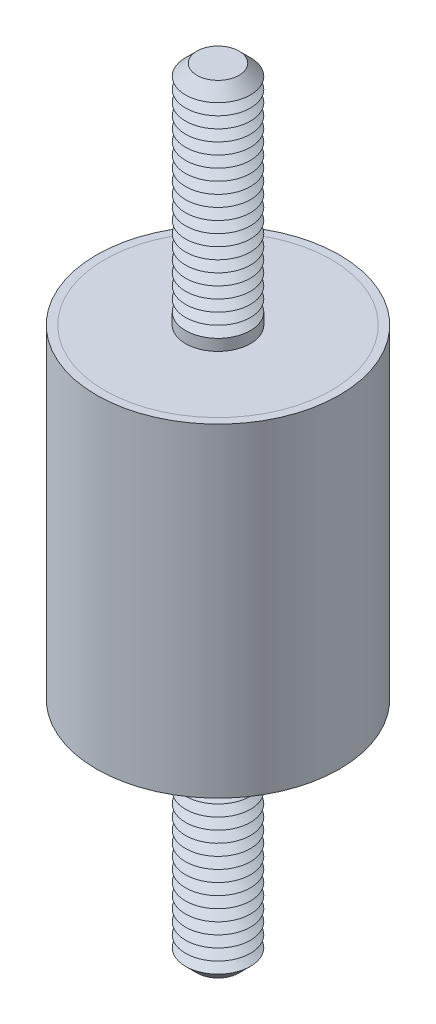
ISO-10303-21;
HEADER;
FILE_DESCRIPTION(('STEP AP214'),'2;1');
FILE_NAME('part.step','',(''),(''),'','','');
FILE_SCHEMA(('AUTOMOTIVE_DESIGN { 1 0 10303 214 1 1 1 1 }'));
ENDSEC;
DATA;
#1=APPLICATION_CONTEXT('core data for automotive mechanical design processes');
#2=APPLICATION_PROTOCOL_DEFINITION('international standard','automotive_design',2000,#1);
#3=PRODUCT_CONTEXT('',#1,'mechanical');
#4=PRODUCT('Part','Part','',(#3));
#5=PRODUCT_RELATED_PRODUCT_CATEGORY('part','',(#4));
#6=PRODUCT_DEFINITION_FORMATION('','',#4);
#7=PRODUCT_DEFINITION_CONTEXT('part definition',#1,'design');
#8=PRODUCT_DEFINITION('design','',#6,#7);
#9=PRODUCT_DEFINITION_SHAPE('','',#8);
#10=(LENGTH_UNIT() NAMED_UNIT(*) SI_UNIT(.MILLI.,.METRE.));
#11=(NAMED_UNIT(*) PLANE_ANGLE_UNIT() SI_UNIT($,.RADIAN.));
#12=(NAMED_UNIT(*) SI_UNIT($,.STERADIAN.) SOLID_ANGLE_UNIT());
#13=UNCERTAINTY_MEASURE_WITH_UNIT(LENGTH_MEASURE(1.E-05),#10,'distance_accuracy_value','');
#14=(GEOMETRIC_REPRESENTATION_CONTEXT(3) GLOBAL_UNCERTAINTY_ASSIGNED_CONTEXT((#13)) GLOBAL_UNIT_ASSIGNED_CONTEXT((#10,
#11,#12)) REPRESENTATION_CONTEXT('',''));
#15=CARTESIAN_POINT('',(0.,0.,0.));
#16=DIRECTION('',(0.,0.,1.));
#17=DIRECTION('',(1.,0.,0.));
#18=AXIS2_PLACEMENT_3D('',#15,#16,#17);
#19=CARTESIAN_POINT('',(0.,-24.,0.));
#20=DIRECTION('',(0.,1.,0.));
#21=DIRECTION('',(0.,0.,1.));
#22=AXIS2_PLACEMENT_3D('',#19,#20,#21);
#23=CYLINDRICAL_SURFACE('',#22,2.);
#24=CARTESIAN_POINT('',(0.,-10.,0.));
#25=DIRECTION('',(0.,-1.,0.));
#26=DIRECTION('',(0.,0.,-1.));
#27=AXIS2_PLACEMENT_3D('',#24,#25,#26);
#28=CIRCLE('',#27,2.);
#29=CARTESIAN_POINT('',(0.,-10.,-2.));
#30=VERTEX_POINT('',#29);
#31=EDGE_CURVE('P0_E21',#30,#30,#28,.T.);
#32=ORIENTED_EDGE('',*,*,#31,.T.);
#33=EDGE_LOOP('',(#32));
#34=FACE_BOUND('',#33,.T.);
#35=CARTESIAN_POINT('',(0.,-10.7,0.));
#36=DIRECTION('',(0.,1.,0.));
#37=DIRECTION('',(0.,0.,1.));
#38=AXIS2_PLACEMENT_3D('',#35,#36,#37);
#39=CIRCLE('',#38,2.);
#40=CARTESIAN_POINT('',(0.,-10.7,2.));
#41=VERTEX_POINT('',#40);
#42=EDGE_CURVE('P0_E33',#41,#41,#39,.T.);
#43=ORIENTED_EDGE('',*,*,#42,.T.);
#44=EDGE_LOOP('',(#43));
#45=FACE_BOUND('',#44,.T.);
#46=ADVANCED_FACE('P0_F14',(#34,#45),#23,.T.);
#47=CARTESIAN_POINT('',(0.,-10.,0.));
#48=DIRECTION('',(0.,1.,0.));
#49=DIRECTION('',(0.,0.,1.));
#50=AXIS2_PLACEMENT_3D('',#47,#48,#49);
#51=CYLINDRICAL_SURFACE('',#50,7.);
#52=CARTESIAN_POINT('',(0.,-10.,0.));
#53=DIRECTION('',(0.,1.,0.));
#54=DIRECTION('',(0.,0.,1.));
#55=AXIS2_PLACEMENT_3D('',#52,#53,#54);
#56=CIRCLE('',#55,7.);
#57=CARTESIAN_POINT('',(0.,-10.,7.));
#58=VERTEX_POINT('',#57);
#59=EDGE_CURVE('P0_E25',#58,#58,#56,.T.);
#60=ORIENTED_EDGE('',*,*,#59,.T.);
#61=EDGE_LOOP('',(#60));
#62=FACE_BOUND('',#61,.T.);
#63=CARTESIAN_POINT('',(0.,-9.,0.));
#64=DIRECTION('',(0.,1.,0.));
#65=DIRECTION('',(0.,0.,1.));
#66=AXIS2_PLACEMENT_3D('',#63,#64,#65);
#67=CIRCLE('',#66,7.);
#68=CARTESIAN_POINT('',(0.,-9.,7.));
#69=VERTEX_POINT('',#68);
#70=EDGE_CURVE('P0_E30',#69,#69,#67,.T.);
#71=ORIENTED_EDGE('',*,*,#70,.F.);
#72=EDGE_LOOP('',(#71));
#73=FACE_BOUND('',#72,.T.);
#74=ADVANCED_FACE('P0_F169',(#62,#73),#51,.T.);
#75=CARTESIAN_POINT('',(0.,-10.,0.));
#76=DIRECTION('',(0.,1.,0.));
#77=DIRECTION('',(0.,0.,1.));
#78=AXIS2_PLACEMENT_3D('',#75,#76,#77);
#79=PLANE('',#78);
#80=ORIENTED_EDGE('',*,*,#31,.F.);
#81=EDGE_LOOP('',(#80));
#82=FACE_BOUND('',#81,.T.);
#83=ORIENTED_EDGE('',*,*,#59,.F.);
#84=EDGE_LOOP('',(#83));
#85=FACE_BOUND('',#84,.T.);
#86=ADVANCED_FACE('P0_F174',(#82,#85),#79,.F.);
#87=CARTESIAN_POINT('',(0.,-9.,0.));
#88=DIRECTION('',(0.,1.,0.));
#89=DIRECTION('',(0.,0.,1.));
#90=AXIS2_PLACEMENT_3D('',#87,#88,#89);
#91=PLANE('',#90);
#92=ORIENTED_EDGE('',*,*,#70,.T.);
#93=EDGE_LOOP('',(#92));
#94=FACE_BOUND('',#93,.T.);
#95=ADVANCED_FACE('P0_F180',(#94),#91,.T.);
#96=CARTESIAN_POINT('',(0.,-10.7,0.));
#97=DIRECTION('',(0.,1.,0.));
#98=DIRECTION('',(0.,0.,1.));
#99=AXIS2_PLACEMENT_3D('',#96,#97,#98);
#100=CONICAL_SURFACE('',#99,2.,1.0471975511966);
#101=CARTESIAN_POINT('',(0.,-11.05,0.));
#102=DIRECTION('',(0.,1.,0.));
#103=DIRECTION('',(0.,0.,1.));
#104=AXIS2_PLACEMENT_3D('',#101,#102,#103);
#105=CIRCLE('',#104,1.39378221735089);
#106=CARTESIAN_POINT('',(0.,-11.05,1.39378221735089));
#107=VERTEX_POINT('',#106);
#108=EDGE_CURVE('P0_E39',#107,#107,#105,.T.);
#109=ORIENTED_EDGE('',*,*,#108,.T.);
#110=EDGE_LOOP('',(#109));
#111=FACE_BOUND('',#110,.T.);
#112=ORIENTED_EDGE('',*,*,#42,.F.);
#113=EDGE_LOOP('',(#112));
#114=FACE_BOUND('',#113,.T.);
#115=ADVANCED_FACE('P0_F183',(#111,#114),#100,.T.);
#116=CARTESIAN_POINT('',(0.,-11.05,0.));
#117=DIRECTION('',(0.,-1.,0.));
#118=DIRECTION('',(0.,0.,-1.));
#119=AXIS2_PLACEMENT_3D('',#116,#117,#118);
#120=CONICAL_SURFACE('',#119,1.39378221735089,1.0471975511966);
#121=CARTESIAN_POINT('',(0.,-11.4,0.));
#122=DIRECTION('',(0.,1.,0.));
#123=DIRECTION('',(0.,0.,1.));
#124=AXIS2_PLACEMENT_3D('',#121,#122,#123);
#125=CIRCLE('',#124,2.);
#126=CARTESIAN_POINT('',(0.,-11.4,2.));
#127=VERTEX_POINT('',#126);
#128=EDGE_CURVE('P0_E43',#127,#127,#125,.T.);
#129=ORIENTED_EDGE('',*,*,#128,.T.);
#130=EDGE_LOOP('',(#129));
#131=FACE_BOUND('',#130,.T.);
#132=ORIENTED_EDGE('',*,*,#108,.F.);
#133=EDGE_LOOP('',(#132));
#134=FACE_BOUND('',#133,.T.);
#135=ADVANCED_FACE('P0_F187',(#131,#134),#120,.T.);
#136=CARTESIAN_POINT('',(0.,-11.4,0.));
#137=DIRECTION('',(0.,1.,0.));
#138=DIRECTION('',(0.,0.,1.));
#139=AXIS2_PLACEMENT_3D('',#136,#137,#138);
#140=CONICAL_SURFACE('',#139,2.,1.0471975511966);
#141=CARTESIAN_POINT('',(0.,-11.75,0.));
#142=DIRECTION('',(0.,1.,0.));
#143=DIRECTION('',(0.,0.,1.));
#144=AXIS2_PLACEMENT_3D('',#141,#142,#143);
#145=CIRCLE('',#144,1.39378221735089);
#146=CARTESIAN_POINT('',(0.,-11.75,1.39378221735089));
#147=VERTEX_POINT('',#146);
#148=EDGE_CURVE('P0_E47',#147,#147,#145,.T.);
#149=ORIENTED_EDGE('',*,*,#148,.T.);
#150=EDGE_LOOP('',(#149));
#151=FACE_BOUND('',#150,.T.);
#152=ORIENTED_EDGE('',*,*,#128,.F.);
#153=EDGE_LOOP('',(#152));
#154=FACE_BOUND('',#153,.T.);
#155=ADVANCED_FACE('P0_F191',(#151,#154),#140,.T.);
#156=CARTESIAN_POINT('',(0.,-11.75,0.));
#157=DIRECTION('',(0.,-1.,0.));
#158=DIRECTION('',(0.,0.,-1.));
#159=AXIS2_PLACEMENT_3D('',#156,#157,#158);
#160=CONICAL_SURFACE('',#159,1.39378221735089,1.0471975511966);
#161=CARTESIAN_POINT('',(0.,-12.1,0.));
#162=DIRECTION('',(0.,1.,0.));
#163=DIRECTION('',(0.,0.,1.));
#164=AXIS2_PLACEMENT_3D('',#161,#162,#163);
#165=CIRCLE('',#164,2.);
#166=CARTESIAN_POINT('',(0.,-12.1,2.));
#167=VERTEX_POINT('',#166);
#168=EDGE_CURVE('P0_E52',#167,#167,#165,.T.);
#169=ORIENTED_EDGE('',*,*,#168,.T.);
#170=EDGE_LOOP('',(#169));
#171=FACE_BOUND('',#170,.T.);
#172=ORIENTED_EDGE('',*,*,#148,.F.);
#173=EDGE_LOOP('',(#172));
#174=FACE_BOUND('',#173,.T.);
#175=ADVANCED_FACE('P0_F198',(#171,#174),#160,.T.);
#176=CARTESIAN_POINT('',(0.,-12.1,0.));
#177=DIRECTION('',(0.,1.,0.));
#178=DIRECTION('',(0.,0.,1.));
#179=AXIS2_PLACEMENT_3D('',#176,#177,#178);
#180=CONICAL_SURFACE('',#179,2.,1.0471975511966);
#181=CARTESIAN_POINT('',(0.,-12.45,0.));
#182=DIRECTION('',(0.,1.,0.));
#183=DIRECTION('',(0.,0.,1.));
#184=AXIS2_PLACEMENT_3D('',#181,#182,#183);
#185=CIRCLE('',#184,1.39378221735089);
#186=CARTESIAN_POINT('',(0.,-12.45,1.39378221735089));
#187=VERTEX_POINT('',#186);
#188=EDGE_CURVE('P0_E55',#187,#187,#185,.T.);
#189=ORIENTED_EDGE('',*,*,#188,.T.);
#190=EDGE_LOOP('',(#189));
#191=FACE_BOUND('',#190,.T.);
#192=ORIENTED_EDGE('',*,*,#168,.F.);
#193=EDGE_LOOP('',(#192));
#194=FACE_BOUND('',#193,.T.);
#195=ADVANCED_FACE('P0_F202',(#191,#194),#180,.T.);
#196=CARTESIAN_POINT('',(0.,-12.45,0.));
#197=DIRECTION('',(0.,-1.,0.));
#198=DIRECTION('',(0.,0.,-1.));
#199=AXIS2_PLACEMENT_3D('',#196,#197,#198);
#200=CONICAL_SURFACE('',#199,1.39378221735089,1.0471975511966);
#201=CARTESIAN_POINT('',(0.,-12.8,0.));
#202=DIRECTION('',(0.,1.,0.));
#203=DIRECTION('',(0.,0.,1.));
#204=AXIS2_PLACEMENT_3D('',#201,#202,#203);
#205=CIRCLE('',#204,2.);
#206=CARTESIAN_POINT('',(0.,-12.8,2.));
#207=VERTEX_POINT('',#206);
#208=EDGE_CURVE('P0_E58',#207,#207,#205,.T.);
#209=ORIENTED_EDGE('',*,*,#208,.T.);
#210=EDGE_LOOP('',(#209));
#211=FACE_BOUND('',#210,.T.);
#212=ORIENTED_EDGE('',*,*,#188,.F.);
#213=EDGE_LOOP('',(#212));
#214=FACE_BOUND('',#213,.T.);
#215=ADVANCED_FACE('P0_F206',(#211,#214),#200,.T.);
#216=CARTESIAN_POINT('',(0.,-12.8,0.));
#217=DIRECTION('',(0.,1.,0.));
#218=DIRECTION('',(0.,0.,1.));
#219=AXIS2_PLACEMENT_3D('',#216,#217,#218);
#220=CONICAL_SURFACE('',#219,2.,1.0471975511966);
#221=CARTESIAN_POINT('',(0.,-13.15,0.));
#222=DIRECTION('',(0.,1.,0.));
#223=DIRECTION('',(0.,0.,1.));
#224=AXIS2_PLACEMENT_3D('',#221,#222,#223);
#225=CIRCLE('',#224,1.39378221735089);
#226=CARTESIAN_POINT('',(0.,-13.15,1.39378221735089));
#227=VERTEX_POINT('',#226);
#228=EDGE_CURVE('P0_E61',#227,#227,#225,.T.);
#229=ORIENTED_EDGE('',*,*,#228,.T.);
#230=EDGE_LOOP('',(#229));
#231=FACE_BOUND('',#230,.T.);
#232=ORIENTED_EDGE('',*,*,#208,.F.);
#233=EDGE_LOOP('',(#232));
#234=FACE_BOUND('',#233,.T.);
#235=ADVANCED_FACE('P0_F210',(#231,#234),#220,.T.);
#236=CARTESIAN_POINT('',(0.,-13.15,0.));
#237=DIRECTION('',(0.,-1.,0.));
#238=DIRECTION('',(0.,0.,-1.));
#239=AXIS2_PLACEMENT_3D('',#236,#237,#238);
#240=CONICAL_SURFACE('',#239,1.39378221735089,1.0471975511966);
#241=CARTESIAN_POINT('',(0.,-13.5,0.));
#242=DIRECTION('',(0.,1.,0.));
#243=DIRECTION('',(0.,0.,1.));
#244=AXIS2_PLACEMENT_3D('',#241,#242,#243);
#245=CIRCLE('',#244,2.);
#246=CARTESIAN_POINT('',(0.,-13.5,2.));
#247=VERTEX_POINT('',#246);
#248=EDGE_CURVE('P0_E64',#247,#247,#245,.T.);
#249=ORIENTED_EDGE('',*,*,#248,.T.);
#250=EDGE_LOOP('',(#249));
#251=FACE_BOUND('',#250,.T.);
#252=ORIENTED_EDGE('',*,*,#228,.F.);
#253=EDGE_LOOP('',(#252));
#254=FACE_BOUND('',#253,.T.);
#255=ADVANCED_FACE('P0_F214',(#251,#254),#240,.T.);
#256=CARTESIAN_POINT('',(0.,-13.5,0.));
#257=DIRECTION('',(0.,1.,0.));
#258=DIRECTION('',(0.,0.,1.));
#259=AXIS2_PLACEMENT_3D('',#256,#257,#258);
#260=CONICAL_SURFACE('',#259,2.,1.0471975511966);
#261=CARTESIAN_POINT('',(0.,-13.85,0.));
#262=DIRECTION('',(0.,1.,0.));
#263=DIRECTION('',(0.,0.,1.));
#264=AXIS2_PLACEMENT_3D('',#261,#262,#263);
#265=CIRCLE('',#264,1.39378221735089);
#266=CARTESIAN_POINT('',(0.,-13.85,1.39378221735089));
#267=VERTEX_POINT('',#266);
#268=EDGE_CURVE('P0_E67',#267,#267,#265,.T.);
#269=ORIENTED_EDGE('',*,*,#268,.T.);
#270=EDGE_LOOP('',(#269));
#271=FACE_BOUND('',#270,.T.);
#272=ORIENTED_EDGE('',*,*,#248,.F.);
#273=EDGE_LOOP('',(#272));
#274=FACE_BOUND('',#273,.T.);
#275=ADVANCED_FACE('P0_F218',(#271,#274),#260,.T.);
#276=CARTESIAN_POINT('',(0.,-13.85,0.));
#277=DIRECTION('',(0.,-1.,0.));
#278=DIRECTION('',(0.,0.,-1.));
#279=AXIS2_PLACEMENT_3D('',#276,#277,#278);
#280=CONICAL_SURFACE('',#279,1.39378221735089,1.0471975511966);
#281=CARTESIAN_POINT('',(0.,-14.2,0.));
#282=DIRECTION('',(0.,1.,0.));
#283=DIRECTION('',(0.,0.,1.));
#284=AXIS2_PLACEMENT_3D('',#281,#282,#283);
#285=CIRCLE('',#284,2.);
#286=CARTESIAN_POINT('',(0.,-14.2,2.));
#287=VERTEX_POINT('',#286);
#288=EDGE_CURVE('P0_E70',#287,#287,#285,.T.);
#289=ORIENTED_EDGE('',*,*,#288,.T.);
#290=EDGE_LOOP('',(#289));
#291=FACE_BOUND('',#290,.T.);
#292=ORIENTED_EDGE('',*,*,#268,.F.);
#293=EDGE_LOOP('',(#292));
#294=FACE_BOUND('',#293,.T.);
#295=ADVANCED_FACE('P0_F222',(#291,#294),#280,.T.);
#296=CARTESIAN_POINT('',(0.,-14.2,0.));
#297=DIRECTION('',(0.,1.,0.));
#298=DIRECTION('',(0.,0.,1.));
#299=AXIS2_PLACEMENT_3D('',#296,#297,#298);
#300=CONICAL_SURFACE('',#299,2.,1.0471975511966);
#301=CARTESIAN_POINT('',(0.,-14.55,0.));
#302=DIRECTION('',(0.,1.,0.));
#303=DIRECTION('',(0.,0.,1.));
#304=AXIS2_PLACEMENT_3D('',#301,#302,#303);
#305=CIRCLE('',#304,1.39378221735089);
#306=CARTESIAN_POINT('',(0.,-14.55,1.39378221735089));
#307=VERTEX_POINT('',#306);
#308=EDGE_CURVE('P0_E73',#307,#307,#305,.T.);
#309=ORIENTED_EDGE('',*,*,#308,.T.);
#310=EDGE_LOOP('',(#309));
#311=FACE_BOUND('',#310,.T.);
#312=ORIENTED_EDGE('',*,*,#288,.F.);
#313=EDGE_LOOP('',(#312));
#314=FACE_BOUND('',#313,.T.);
#315=ADVANCED_FACE('P0_F226',(#311,#314),#300,.T.);
#316=CARTESIAN_POINT('',(0.,-14.55,0.));
#317=DIRECTION('',(0.,-1.,0.));
#318=DIRECTION('',(0.,0.,-1.));
#319=AXIS2_PLACEMENT_3D('',#316,#317,#318);
#320=CONICAL_SURFACE('',#319,1.39378221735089,1.0471975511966);
#321=CARTESIAN_POINT('',(0.,-14.9,0.));
#322=DIRECTION('',(0.,1.,0.));
#323=DIRECTION('',(0.,0.,1.));
#324=AXIS2_PLACEMENT_3D('',#321,#322,#323);
#325=CIRCLE('',#324,2.);
#326=CARTESIAN_POINT('',(0.,-14.9,2.));
#327=VERTEX_POINT('',#326);
#328=EDGE_CURVE('P0_E76',#327,#327,#325,.T.);
#329=ORIENTED_EDGE('',*,*,#328,.T.);
#330=EDGE_LOOP('',(#329));
#331=FACE_BOUND('',#330,.T.);
#332=ORIENTED_EDGE('',*,*,#308,.F.);
#333=EDGE_LOOP('',(#332));
#334=FACE_BOUND('',#333,.T.);
#335=ADVANCED_FACE('P0_F230',(#331,#334),#320,.T.);
#336=CARTESIAN_POINT('',(0.,-14.9,0.));
#337=DIRECTION('',(0.,1.,0.));
#338=DIRECTION('',(0.,0.,1.));
#339=AXIS2_PLACEMENT_3D('',#336,#337,#338);
#340=CONICAL_SURFACE('',#339,2.,1.0471975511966);
#341=CARTESIAN_POINT('',(0.,-15.25,0.));
#342=DIRECTION('',(0.,1.,0.));
#343=DIRECTION('',(0.,0.,1.));
#344=AXIS2_PLACEMENT_3D('',#341,#342,#343);
#345=CIRCLE('',#344,1.39378221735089);
#346=CARTESIAN_POINT('',(0.,-15.25,1.39378221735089));
#347=VERTEX_POINT('',#346);
#348=EDGE_CURVE('P0_E79',#347,#347,#345,.T.);
#349=ORIENTED_EDGE('',*,*,#348,.T.);
#350=EDGE_LOOP('',(#349));
#351=FACE_BOUND('',#350,.T.);
#352=ORIENTED_EDGE('',*,*,#328,.F.);
#353=EDGE_LOOP('',(#352));
#354=FACE_BOUND('',#353,.T.);
#355=ADVANCED_FACE('P0_F234',(#351,#354),#340,.T.);
#356=CARTESIAN_POINT('',(0.,-15.25,0.));
#357=DIRECTION('',(0.,-1.,0.));
#358=DIRECTION('',(0.,0.,-1.));
#359=AXIS2_PLACEMENT_3D('',#356,#357,#358);
#360=CONICAL_SURFACE('',#359,1.39378221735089,1.0471975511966);
#361=CARTESIAN_POINT('',(0.,-15.6,0.));
#362=DIRECTION('',(0.,1.,0.));
#363=DIRECTION('',(0.,0.,1.));
#364=AXIS2_PLACEMENT_3D('',#361,#362,#363);
#365=CIRCLE('',#364,2.);
#366=CARTESIAN_POINT('',(0.,-15.6,2.));
#367=VERTEX_POINT('',#366);
#368=EDGE_CURVE('P0_E82',#367,#367,#365,.T.);
#369=ORIENTED_EDGE('',*,*,#368,.T.);
#370=EDGE_LOOP('',(#369));
#371=FACE_BOUND('',#370,.T.);
#372=ORIENTED_EDGE('',*,*,#348,.F.);
#373=EDGE_LOOP('',(#372));
#374=FACE_BOUND('',#373,.T.);
#375=ADVANCED_FACE('P0_F238',(#371,#374),#360,.T.);
#376=CARTESIAN_POINT('',(0.,-15.6,0.));
#377=DIRECTION('',(0.,1.,0.));
#378=DIRECTION('',(0.,0.,1.));
#379=AXIS2_PLACEMENT_3D('',#376,#377,#378);
#380=CONICAL_SURFACE('',#379,2.,1.0471975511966);
#381=CARTESIAN_POINT('',(0.,-15.95,0.));
#382=DIRECTION('',(0.,1.,0.));
#383=DIRECTION('',(0.,0.,1.));
#384=AXIS2_PLACEMENT_3D('',#381,#382,#383);
#385=CIRCLE('',#384,1.39378221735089);
#386=CARTESIAN_POINT('',(0.,-15.95,1.39378221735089));
#387=VERTEX_POINT('',#386);
#388=EDGE_CURVE('P0_E85',#387,#387,#385,.T.);
#389=ORIENTED_EDGE('',*,*,#388,.T.);
#390=EDGE_LOOP('',(#389));
#391=FACE_BOUND('',#390,.T.);
#392=ORIENTED_EDGE('',*,*,#368,.F.);
#393=EDGE_LOOP('',(#392));
#394=FACE_BOUND('',#393,.T.);
#395=ADVANCED_FACE('P0_F242',(#391,#394),#380,.T.);
#396=CARTESIAN_POINT('',(0.,-15.95,0.));
#397=DIRECTION('',(0.,-1.,0.));
#398=DIRECTION('',(0.,0.,-1.));
#399=AXIS2_PLACEMENT_3D('',#396,#397,#398);
#400=CONICAL_SURFACE('',#399,1.39378221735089,1.0471975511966);
#401=CARTESIAN_POINT('',(0.,-16.3,0.));
#402=DIRECTION('',(0.,1.,0.));
#403=DIRECTION('',(0.,0.,1.));
#404=AXIS2_PLACEMENT_3D('',#401,#402,#403);
#405=CIRCLE('',#404,2.);
#406=CARTESIAN_POINT('',(0.,-16.3,2.));
#407=VERTEX_POINT('',#406);
#408=EDGE_CURVE('P0_E88',#407,#407,#405,.T.);
#409=ORIENTED_EDGE('',*,*,#408,.T.);
#410=EDGE_LOOP('',(#409));
#411=FACE_BOUND('',#410,.T.);
#412=ORIENTED_EDGE('',*,*,#388,.F.);
#413=EDGE_LOOP('',(#412));
#414=FACE_BOUND('',#413,.T.);
#415=ADVANCED_FACE('P0_F246',(#411,#414),#400,.T.);
#416=CARTESIAN_POINT('',(0.,-16.3,0.));
#417=DIRECTION('',(0.,1.,0.));
#418=DIRECTION('',(0.,0.,1.));
#419=AXIS2_PLACEMENT_3D('',#416,#417,#418);
#420=CONICAL_SURFACE('',#419,2.,1.0471975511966);
#421=CARTESIAN_POINT('',(0.,-16.65,0.));
#422=DIRECTION('',(0.,1.,0.));
#423=DIRECTION('',(0.,0.,1.));
#424=AXIS2_PLACEMENT_3D('',#421,#422,#423);
#425=CIRCLE('',#424,1.39378221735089);
#426=CARTESIAN_POINT('',(0.,-16.65,1.39378221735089));
#427=VERTEX_POINT('',#426);
#428=EDGE_CURVE('P0_E91',#427,#427,#425,.T.);
#429=ORIENTED_EDGE('',*,*,#428,.T.);
#430=EDGE_LOOP('',(#429));
#431=FACE_BOUND('',#430,.T.);
#432=ORIENTED_EDGE('',*,*,#408,.F.);
#433=EDGE_LOOP('',(#432));
#434=FACE_BOUND('',#433,.T.);
#435=ADVANCED_FACE('P0_F250',(#431,#434),#420,.T.);
#436=CARTESIAN_POINT('',(0.,-16.65,0.));
#437=DIRECTION('',(0.,-1.,0.));
#438=DIRECTION('',(0.,0.,-1.));
#439=AXIS2_PLACEMENT_3D('',#436,#437,#438);
#440=CONICAL_SURFACE('',#439,1.39378221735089,1.0471975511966);
#441=CARTESIAN_POINT('',(0.,-17.,0.));
#442=DIRECTION('',(0.,1.,0.));
#443=DIRECTION('',(0.,0.,1.));
#444=AXIS2_PLACEMENT_3D('',#441,#442,#443);
#445=CIRCLE('',#444,2.);
#446=CARTESIAN_POINT('',(0.,-17.,2.));
#447=VERTEX_POINT('',#446);
#448=EDGE_CURVE('P0_E94',#447,#447,#445,.T.);
#449=ORIENTED_EDGE('',*,*,#448,.T.);
#450=EDGE_LOOP('',(#449));
#451=FACE_BOUND('',#450,.T.);
#452=ORIENTED_EDGE('',*,*,#428,.F.);
#453=EDGE_LOOP('',(#452));
#454=FACE_BOUND('',#453,.T.);
#455=ADVANCED_FACE('P0_F254',(#451,#454),#440,.T.);
#456=CARTESIAN_POINT('',(0.,-17.,0.));
#457=DIRECTION('',(0.,1.,0.));
#458=DIRECTION('',(0.,0.,1.));
#459=AXIS2_PLACEMENT_3D('',#456,#457,#458);
#460=CONICAL_SURFACE('',#459,2.,1.0471975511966);
#461=CARTESIAN_POINT('',(0.,-17.35,0.));
#462=DIRECTION('',(0.,1.,0.));
#463=DIRECTION('',(0.,0.,1.));
#464=AXIS2_PLACEMENT_3D('',#461,#462,#463);
#465=CIRCLE('',#464,1.39378221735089);
#466=CARTESIAN_POINT('',(0.,-17.35,1.39378221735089));
#467=VERTEX_POINT('',#466);
#468=EDGE_CURVE('P0_E97',#467,#467,#465,.T.);
#469=ORIENTED_EDGE('',*,*,#468,.T.);
#470=EDGE_LOOP('',(#469));
#471=FACE_BOUND('',#470,.T.);
#472=ORIENTED_EDGE('',*,*,#448,.F.);
#473=EDGE_LOOP('',(#472));
#474=FACE_BOUND('',#473,.T.);
#475=ADVANCED_FACE('P0_F258',(#471,#474),#460,.T.);
#476=CARTESIAN_POINT('',(0.,-17.35,0.));
#477=DIRECTION('',(0.,-1.,0.));
#478=DIRECTION('',(0.,0.,-1.));
#479=AXIS2_PLACEMENT_3D('',#476,#477,#478);
#480=CONICAL_SURFACE('',#479,1.39378221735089,1.0471975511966);
#481=CARTESIAN_POINT('',(0.,-17.7,0.));
#482=DIRECTION('',(0.,1.,0.));
#483=DIRECTION('',(0.,0.,1.));
#484=AXIS2_PLACEMENT_3D('',#481,#482,#483);
#485=CIRCLE('',#484,2.);
#486=CARTESIAN_POINT('',(0.,-17.7,2.));
#487=VERTEX_POINT('',#486);
#488=EDGE_CURVE('P0_E100',#487,#487,#485,.T.);
#489=ORIENTED_EDGE('',*,*,#488,.T.);
#490=EDGE_LOOP('',(#489));
#491=FACE_BOUND('',#490,.T.);
#492=ORIENTED_EDGE('',*,*,#468,.F.);
#493=EDGE_LOOP('',(#492));
#494=FACE_BOUND('',#493,.T.);
#495=ADVANCED_FACE('P0_F262',(#491,#494),#480,.T.);
#496=CARTESIAN_POINT('',(0.,-17.7,0.));
#497=DIRECTION('',(0.,1.,0.));
#498=DIRECTION('',(0.,0.,1.));
#499=AXIS2_PLACEMENT_3D('',#496,#497,#498);
#500=CONICAL_SURFACE('',#499,2.,1.0471975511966);
#501=CARTESIAN_POINT('',(0.,-18.05,0.));
#502=DIRECTION('',(0.,1.,0.));
#503=DIRECTION('',(0.,0.,1.));
#504=AXIS2_PLACEMENT_3D('',#501,#502,#503);
#505=CIRCLE('',#504,1.39378221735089);
#506=CARTESIAN_POINT('',(0.,-18.05,1.39378221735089));
#507=VERTEX_POINT('',#506);
#508=EDGE_CURVE('P0_E103',#507,#507,#505,.T.);
#509=ORIENTED_EDGE('',*,*,#508,.T.);
#510=EDGE_LOOP('',(#509));
#511=FACE_BOUND('',#510,.T.);
#512=ORIENTED_EDGE('',*,*,#488,.F.);
#513=EDGE_LOOP('',(#512));
#514=FACE_BOUND('',#513,.T.);
#515=ADVANCED_FACE('P0_F266',(#511,#514),#500,.T.);
#516=CARTESIAN_POINT('',(0.,-18.05,0.));
#517=DIRECTION('',(0.,-1.,0.));
#518=DIRECTION('',(0.,0.,-1.));
#519=AXIS2_PLACEMENT_3D('',#516,#517,#518);
#520=CONICAL_SURFACE('',#519,1.39378221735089,1.0471975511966);
#521=CARTESIAN_POINT('',(0.,-18.4,0.));
#522=DIRECTION('',(0.,1.,0.));
#523=DIRECTION('',(0.,0.,1.));
#524=AXIS2_PLACEMENT_3D('',#521,#522,#523);
#525=CIRCLE('',#524,2.);
#526=CARTESIAN_POINT('',(0.,-18.4,2.));
#527=VERTEX_POINT('',#526);
#528=EDGE_CURVE('P0_E106',#527,#527,#525,.T.);
#529=ORIENTED_EDGE('',*,*,#528,.T.);
#530=EDGE_LOOP('',(#529));
#531=FACE_BOUND('',#530,.T.);
#532=ORIENTED_EDGE('',*,*,#508,.F.);
#533=EDGE_LOOP('',(#532));
#534=FACE_BOUND('',#533,.T.);
#535=ADVANCED_FACE('P0_F270',(#531,#534),#520,.T.);
#536=CARTESIAN_POINT('',(0.,-18.4,0.));
#537=DIRECTION('',(0.,1.,0.));
#538=DIRECTION('',(0.,0.,1.));
#539=AXIS2_PLACEMENT_3D('',#536,#537,#538);
#540=CONICAL_SURFACE('',#539,2.,1.0471975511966);
#541=CARTESIAN_POINT('',(0.,-18.75,0.));
#542=DIRECTION('',(0.,1.,0.));
#543=DIRECTION('',(0.,0.,1.));
#544=AXIS2_PLACEMENT_3D('',#541,#542,#543);
#545=CIRCLE('',#544,1.39378221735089);
#546=CARTESIAN_POINT('',(0.,-18.75,1.39378221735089));
#547=VERTEX_POINT('',#546);
#548=EDGE_CURVE('P0_E109',#547,#547,#545,.T.);
#549=ORIENTED_EDGE('',*,*,#548,.T.);
#550=EDGE_LOOP('',(#549));
#551=FACE_BOUND('',#550,.T.);
#552=ORIENTED_EDGE('',*,*,#528,.F.);
#553=EDGE_LOOP('',(#552));
#554=FACE_BOUND('',#553,.T.);
#555=ADVANCED_FACE('P0_F274',(#551,#554),#540,.T.);
#556=CARTESIAN_POINT('',(0.,-18.75,0.));
#557=DIRECTION('',(0.,-1.,0.));
#558=DIRECTION('',(0.,0.,-1.));
#559=AXIS2_PLACEMENT_3D('',#556,#557,#558);
#560=CONICAL_SURFACE('',#559,1.39378221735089,1.0471975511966);
#561=CARTESIAN_POINT('',(0.,-19.1,0.));
#562=DIRECTION('',(0.,1.,0.));
#563=DIRECTION('',(0.,0.,1.));
#564=AXIS2_PLACEMENT_3D('',#561,#562,#563);
#565=CIRCLE('',#564,2.);
#566=CARTESIAN_POINT('',(0.,-19.1,2.));
#567=VERTEX_POINT('',#566);
#568=EDGE_CURVE('P0_E112',#567,#567,#565,.T.);
#569=ORIENTED_EDGE('',*,*,#568,.T.);
#570=EDGE_LOOP('',(#569));
#571=FACE_BOUND('',#570,.T.);
#572=ORIENTED_EDGE('',*,*,#548,.F.);
#573=EDGE_LOOP('',(#572));
#574=FACE_BOUND('',#573,.T.);
#575=ADVANCED_FACE('P0_F278',(#571,#574),#560,.T.);
#576=CARTESIAN_POINT('',(0.,-19.1,0.));
#577=DIRECTION('',(0.,1.,0.));
#578=DIRECTION('',(0.,0.,1.));
#579=AXIS2_PLACEMENT_3D('',#576,#577,#578);
#580=CONICAL_SURFACE('',#579,2.,1.0471975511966);
#581=CARTESIAN_POINT('',(0.,-19.45,0.));
#582=DIRECTION('',(0.,1.,0.));
#583=DIRECTION('',(0.,0.,1.));
#584=AXIS2_PLACEMENT_3D('',#581,#582,#583);
#585=CIRCLE('',#584,1.39378221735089);
#586=CARTESIAN_POINT('',(0.,-19.45,1.39378221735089));
#587=VERTEX_POINT('',#586);
#588=EDGE_CURVE('P0_E115',#587,#587,#585,.T.);
#589=ORIENTED_EDGE('',*,*,#588,.T.);
#590=EDGE_LOOP('',(#589));
#591=FACE_BOUND('',#590,.T.);
#592=ORIENTED_EDGE('',*,*,#568,.F.);
#593=EDGE_LOOP('',(#592));
#594=FACE_BOUND('',#593,.T.);
#595=ADVANCED_FACE('P0_F282',(#591,#594),#580,.T.);
#596=CARTESIAN_POINT('',(0.,-19.45,0.));
#597=DIRECTION('',(0.,-1.,0.));
#598=DIRECTION('',(0.,0.,-1.));
#599=AXIS2_PLACEMENT_3D('',#596,#597,#598);
#600=CONICAL_SURFACE('',#599,1.39378221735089,1.0471975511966);
#601=CARTESIAN_POINT('',(0.,-19.8,0.));
#602=DIRECTION('',(0.,1.,0.));
#603=DIRECTION('',(0.,0.,1.));
#604=AXIS2_PLACEMENT_3D('',#601,#602,#603);
#605=CIRCLE('',#604,2.);
#606=CARTESIAN_POINT('',(0.,-19.8,2.));
#607=VERTEX_POINT('',#606);
#608=EDGE_CURVE('P0_E118',#607,#607,#605,.T.);
#609=ORIENTED_EDGE('',*,*,#608,.T.);
#610=EDGE_LOOP('',(#609));
#611=FACE_BOUND('',#610,.T.);
#612=ORIENTED_EDGE('',*,*,#588,.F.);
#613=EDGE_LOOP('',(#612));
#614=FACE_BOUND('',#613,.T.);
#615=ADVANCED_FACE('P0_F286',(#611,#614),#600,.T.);
#616=CARTESIAN_POINT('',(0.,-19.8,0.));
#617=DIRECTION('',(0.,1.,0.));
#618=DIRECTION('',(0.,0.,1.));
#619=AXIS2_PLACEMENT_3D('',#616,#617,#618);
#620=CONICAL_SURFACE('',#619,2.,1.0471975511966);
#621=CARTESIAN_POINT('',(0.,-20.15,0.));
#622=DIRECTION('',(0.,1.,0.));
#623=DIRECTION('',(0.,0.,1.));
#624=AXIS2_PLACEMENT_3D('',#621,#622,#623);
#625=CIRCLE('',#624,1.39378221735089);
#626=CARTESIAN_POINT('',(0.,-20.15,1.39378221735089));
#627=VERTEX_POINT('',#626);
#628=EDGE_CURVE('P0_E121',#627,#627,#625,.T.);
#629=ORIENTED_EDGE('',*,*,#628,.T.);
#630=EDGE_LOOP('',(#629));
#631=FACE_BOUND('',#630,.T.);
#632=ORIENTED_EDGE('',*,*,#608,.F.);
#633=EDGE_LOOP('',(#632));
#634=FACE_BOUND('',#633,.T.);
#635=ADVANCED_FACE('P0_F290',(#631,#634),#620,.T.);
#636=CARTESIAN_POINT('',(0.,-20.15,0.));
#637=DIRECTION('',(0.,-1.,0.));
#638=DIRECTION('',(0.,0.,-1.));
#639=AXIS2_PLACEMENT_3D('',#636,#637,#638);
#640=CONICAL_SURFACE('',#639,1.39378221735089,1.0471975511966);
#641=CARTESIAN_POINT('',(0.,-20.5,0.));
#642=DIRECTION('',(0.,1.,0.));
#643=DIRECTION('',(0.,0.,1.));
#644=AXIS2_PLACEMENT_3D('',#641,#642,#643);
#645=CIRCLE('',#644,2.);
#646=CARTESIAN_POINT('',(0.,-20.5,2.));
#647=VERTEX_POINT('',#646);
#648=EDGE_CURVE('P0_E124',#647,#647,#645,.T.);
#649=ORIENTED_EDGE('',*,*,#648,.T.);
#650=EDGE_LOOP('',(#649));
#651=FACE_BOUND('',#650,.T.);
#652=ORIENTED_EDGE('',*,*,#628,.F.);
#653=EDGE_LOOP('',(#652));
#654=FACE_BOUND('',#653,.T.);
#655=ADVANCED_FACE('P0_F294',(#651,#654),#640,.T.);
#656=CARTESIAN_POINT('',(0.,-20.5,0.));
#657=DIRECTION('',(0.,1.,0.));
#658=DIRECTION('',(0.,0.,1.));
#659=AXIS2_PLACEMENT_3D('',#656,#657,#658);
#660=CONICAL_SURFACE('',#659,2.,1.0471975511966);
#661=CARTESIAN_POINT('',(0.,-20.85,0.));
#662=DIRECTION('',(0.,1.,0.));
#663=DIRECTION('',(0.,0.,1.));
#664=AXIS2_PLACEMENT_3D('',#661,#662,#663);
#665=CIRCLE('',#664,1.39378221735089);
#666=CARTESIAN_POINT('',(0.,-20.85,1.39378221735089));
#667=VERTEX_POINT('',#666);
#668=EDGE_CURVE('P0_E127',#667,#667,#665,.T.);
#669=ORIENTED_EDGE('',*,*,#668,.T.);
#670=EDGE_LOOP('',(#669));
#671=FACE_BOUND('',#670,.T.);
#672=ORIENTED_EDGE('',*,*,#648,.F.);
#673=EDGE_LOOP('',(#672));
#674=FACE_BOUND('',#673,.T.);
#675=ADVANCED_FACE('P0_F298',(#671,#674),#660,.T.);
#676=CARTESIAN_POINT('',(0.,-20.85,0.));
#677=DIRECTION('',(0.,-1.,0.));
#678=DIRECTION('',(0.,0.,-1.));
#679=AXIS2_PLACEMENT_3D('',#676,#677,#678);
#680=CONICAL_SURFACE('',#679,1.39378221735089,1.0471975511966);
#681=CARTESIAN_POINT('',(0.,-21.2,0.));
#682=DIRECTION('',(0.,1.,0.));
#683=DIRECTION('',(0.,0.,1.));
#684=AXIS2_PLACEMENT_3D('',#681,#682,#683);
#685=CIRCLE('',#684,2.);
#686=CARTESIAN_POINT('',(0.,-21.2,2.));
#687=VERTEX_POINT('',#686);
#688=EDGE_CURVE('P0_E130',#687,#687,#685,.T.);
#689=ORIENTED_EDGE('',*,*,#688,.T.);
#690=EDGE_LOOP('',(#689));
#691=FACE_BOUND('',#690,.T.);
#692=ORIENTED_EDGE('',*,*,#668,.F.);
#693=EDGE_LOOP('',(#692));
#694=FACE_BOUND('',#693,.T.);
#695=ADVANCED_FACE('P0_F302',(#691,#694),#680,.T.);
#696=CARTESIAN_POINT('',(0.,-21.2,0.));
#697=DIRECTION('',(0.,1.,0.));
#698=DIRECTION('',(0.,0.,1.));
#699=AXIS2_PLACEMENT_3D('',#696,#697,#698);
#700=CONICAL_SURFACE('',#699,2.,1.0471975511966);
#701=CARTESIAN_POINT('',(0.,-21.55,0.));
#702=DIRECTION('',(0.,1.,0.));
#703=DIRECTION('',(0.,0.,1.));
#704=AXIS2_PLACEMENT_3D('',#701,#702,#703);
#705=CIRCLE('',#704,1.39378221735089);
#706=CARTESIAN_POINT('',(0.,-21.55,1.39378221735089));
#707=VERTEX_POINT('',#706);
#708=EDGE_CURVE('P0_E133',#707,#707,#705,.T.);
#709=ORIENTED_EDGE('',*,*,#708,.T.);
#710=EDGE_LOOP('',(#709));
#711=FACE_BOUND('',#710,.T.);
#712=ORIENTED_EDGE('',*,*,#688,.F.);
#713=EDGE_LOOP('',(#712));
#714=FACE_BOUND('',#713,.T.);
#715=ADVANCED_FACE('P0_F306',(#711,#714),#700,.T.);
#716=CARTESIAN_POINT('',(0.,-21.55,0.));
#717=DIRECTION('',(0.,-1.,0.));
#718=DIRECTION('',(0.,0.,-1.));
#719=AXIS2_PLACEMENT_3D('',#716,#717,#718);
#720=CONICAL_SURFACE('',#719,1.39378221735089,1.0471975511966);
#721=CARTESIAN_POINT('',(0.,-21.9,0.));
#722=DIRECTION('',(0.,1.,0.));
#723=DIRECTION('',(0.,0.,1.));
#724=AXIS2_PLACEMENT_3D('',#721,#722,#723);
#725=CIRCLE('',#724,2.);
#726=CARTESIAN_POINT('',(0.,-21.9,2.));
#727=VERTEX_POINT('',#726);
#728=EDGE_CURVE('P0_E136',#727,#727,#725,.T.);
#729=ORIENTED_EDGE('',*,*,#728,.T.);
#730=EDGE_LOOP('',(#729));
#731=FACE_BOUND('',#730,.T.);
#732=ORIENTED_EDGE('',*,*,#708,.F.);
#733=EDGE_LOOP('',(#732));
#734=FACE_BOUND('',#733,.T.);
#735=ADVANCED_FACE('P0_F310',(#731,#734),#720,.T.);
#736=CARTESIAN_POINT('',(0.,-21.9,0.));
#737=DIRECTION('',(0.,1.,0.));
#738=DIRECTION('',(0.,0.,1.));
#739=AXIS2_PLACEMENT_3D('',#736,#737,#738);
#740=CONICAL_SURFACE('',#739,2.,1.0471975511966);
#741=CARTESIAN_POINT('',(0.,-22.25,0.));
#742=DIRECTION('',(0.,1.,0.));
#743=DIRECTION('',(0.,0.,1.));
#744=AXIS2_PLACEMENT_3D('',#741,#742,#743);
#745=CIRCLE('',#744,1.39378221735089);
#746=CARTESIAN_POINT('',(0.,-22.25,1.39378221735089));
#747=VERTEX_POINT('',#746);
#748=EDGE_CURVE('P0_E139',#747,#747,#745,.T.);
#749=ORIENTED_EDGE('',*,*,#748,.T.);
#750=EDGE_LOOP('',(#749));
#751=FACE_BOUND('',#750,.T.);
#752=ORIENTED_EDGE('',*,*,#728,.F.);
#753=EDGE_LOOP('',(#752));
#754=FACE_BOUND('',#753,.T.);
#755=ADVANCED_FACE('P0_F314',(#751,#754),#740,.T.);
#756=CARTESIAN_POINT('',(0.,-22.25,0.));
#757=DIRECTION('',(0.,-1.,0.));
#758=DIRECTION('',(0.,0.,-1.));
#759=AXIS2_PLACEMENT_3D('',#756,#757,#758);
#760=CONICAL_SURFACE('',#759,1.39378221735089,1.0471975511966);
#761=CARTESIAN_POINT('',(0.,-22.6,0.));
#762=DIRECTION('',(0.,1.,0.));
#763=DIRECTION('',(0.,0.,1.));
#764=AXIS2_PLACEMENT_3D('',#761,#762,#763);
#765=CIRCLE('',#764,2.);
#766=CARTESIAN_POINT('',(0.,-22.6,2.));
#767=VERTEX_POINT('',#766);
#768=EDGE_CURVE('P0_E142',#767,#767,#765,.T.);
#769=ORIENTED_EDGE('',*,*,#768,.T.);
#770=EDGE_LOOP('',(#769));
#771=FACE_BOUND('',#770,.T.);
#772=ORIENTED_EDGE('',*,*,#748,.F.);
#773=EDGE_LOOP('',(#772));
#774=FACE_BOUND('',#773,.T.);
#775=ADVANCED_FACE('P0_F166',(#771,#774),#760,.T.);
#776=CARTESIAN_POINT('',(0.,-22.6,0.));
#777=DIRECTION('',(0.,1.,0.));
#778=DIRECTION('',(0.,0.,1.));
#779=AXIS2_PLACEMENT_3D('',#776,#777,#778);
#780=CONICAL_SURFACE('',#779,2.,1.0471975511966);
#781=CARTESIAN_POINT('',(0.,-22.95,0.));
#782=DIRECTION('',(0.,1.,0.));
#783=DIRECTION('',(0.,0.,1.));
#784=AXIS2_PLACEMENT_3D('',#781,#782,#783);
#785=CIRCLE('',#784,1.39378221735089);
#786=CARTESIAN_POINT('',(0.,-22.95,1.39378221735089));
#787=VERTEX_POINT('',#786);
#788=EDGE_CURVE('P0_E148',#787,#787,#785,.T.);
#789=ORIENTED_EDGE('',*,*,#788,.T.);
#790=EDGE_LOOP('',(#789));
#791=FACE_BOUND('',#790,.T.);
#792=ORIENTED_EDGE('',*,*,#768,.F.);
#793=EDGE_LOOP('',(#792));
#794=FACE_BOUND('',#793,.T.);
#795=ADVANCED_FACE('P0_F152',(#791,#794),#780,.T.);
#796=CARTESIAN_POINT('',(0.,-22.95,0.));
#797=DIRECTION('',(0.,-1.,0.));
#798=DIRECTION('',(0.,0.,-1.));
#799=AXIS2_PLACEMENT_3D('',#796,#797,#798);
#800=CONICAL_SURFACE('',#799,1.39378221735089,1.0471975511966);
#801=CARTESIAN_POINT('',(0.,-23.3,0.));
#802=DIRECTION('',(0.,1.,0.));
#803=DIRECTION('',(0.,0.,1.));
#804=AXIS2_PLACEMENT_3D('',#801,#802,#803);
#805=CIRCLE('',#804,2.);
#806=CARTESIAN_POINT('',(0.,-23.3,2.));
#807=VERTEX_POINT('',#806);
#808=EDGE_CURVE('P0_E145',#807,#807,#805,.T.);
#809=ORIENTED_EDGE('',*,*,#808,.T.);
#810=EDGE_LOOP('',(#809));
#811=FACE_BOUND('',#810,.T.);
#812=ORIENTED_EDGE('',*,*,#788,.F.);
#813=EDGE_LOOP('',(#812));
#814=FACE_BOUND('',#813,.T.);
#815=ADVANCED_FACE('P0_F155',(#811,#814),#800,.T.);
#816=CARTESIAN_POINT('',(0.,-24.,0.));
#817=DIRECTION('',(0.,-1.,0.));
#818=DIRECTION('',(0.,0.,-1.));
#819=AXIS2_PLACEMENT_3D('',#816,#817,#818);
#820=PLANE('',#819);
#821=CARTESIAN_POINT('',(0.,-24.,0.));
#822=DIRECTION('',(0.,-1.,0.));
#823=DIRECTION('',(0.,0.,-1.));
#824=AXIS2_PLACEMENT_3D('',#821,#822,#823);
#825=CIRCLE('',#824,1.3);
#826=CARTESIAN_POINT('',(0.,-24.,-1.3));
#827=VERTEX_POINT('',#826);
#828=EDGE_CURVE('P0_E10',#827,#827,#825,.T.);
#829=ORIENTED_EDGE('',*,*,#828,.T.);
#830=EDGE_LOOP('',(#829));
#831=FACE_BOUND('',#830,.T.);
#832=ADVANCED_FACE('P0_F157',(#831),#820,.T.);
#833=CARTESIAN_POINT('',(0.,-24.,0.));
#834=DIRECTION('',(0.,1.,0.));
#835=DIRECTION('',(0.,0.,1.));
#836=AXIS2_PLACEMENT_3D('',#833,#834,#835);
#837=CONICAL_SURFACE('',#836,1.3,0.785398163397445);
#838=ORIENTED_EDGE('',*,*,#808,.F.);
#839=EDGE_LOOP('',(#838));
#840=FACE_BOUND('',#839,.T.);
#841=ORIENTED_EDGE('',*,*,#828,.F.);
#842=EDGE_LOOP('',(#841));
#843=FACE_BOUND('',#842,.T.);
#844=ADVANCED_FACE('P0_F16',(#840,#843),#837,.T.);
#845=CLOSED_SHELL('',(#46,#74,#86,#95,#115,#135,#155,#175,#195,#215,#235,#255,#275,#295,#315,
#335,#355,#375,#395,#415,#435,#455,#475,#495,#515,#535,#555,#575,#595,#615,#635,#655,#675,#695,
#715,#735,#755,#775,#795,#815,#832,#844));
#846=MANIFOLD_SOLID_BREP('P0_B1',#845);
#847=CARTESIAN_POINT('',(0.,24.,0.));
#848=DIRECTION('',(0.,-1.,0.));
#849=DIRECTION('',(0.,0.,-1.));
#850=AXIS2_PLACEMENT_3D('',#847,#848,#849);
#851=CYLINDRICAL_SURFACE('',#850,2.);
#852=CARTESIAN_POINT('',(0.,10.7,0.));
#853=DIRECTION('',(0.,1.,0.));
#854=DIRECTION('',(0.,0.,1.));
#855=AXIS2_PLACEMENT_3D('',#852,#853,#854);
#856=CIRCLE('',#855,2.);
#857=CARTESIAN_POINT('',(0.,10.7,2.));
#858=VERTEX_POINT('',#857);
#859=EDGE_CURVE('P1_E33',#858,#858,#856,.T.);
#860=ORIENTED_EDGE('',*,*,#859,.F.);
#861=EDGE_LOOP('',(#860));
#862=FACE_BOUND('',#861,.T.);
#863=CARTESIAN_POINT('',(0.,10.,0.));
#864=DIRECTION('',(0.,1.,0.));
#865=DIRECTION('',(0.,0.,1.));
#866=AXIS2_PLACEMENT_3D('',#863,#864,#865);
#867=CIRCLE('',#866,2.);
#868=CARTESIAN_POINT('',(0.,10.,2.));
#869=VERTEX_POINT('',#868);
#870=EDGE_CURVE('P1_E21',#869,#869,#867,.T.);
#871=ORIENTED_EDGE('',*,*,#870,.T.);
#872=EDGE_LOOP('',(#871));
#873=FACE_BOUND('',#872,.T.);
#874=ADVANCED_FACE('P1_F14',(#862,#873),#851,.T.);
#875=CARTESIAN_POINT('',(0.,10.,0.));
#876=DIRECTION('',(0.,-1.,0.));
#877=DIRECTION('',(0.,0.,-1.));
#878=AXIS2_PLACEMENT_3D('',#875,#876,#877);
#879=CYLINDRICAL_SURFACE('',#878,7.);
#880=CARTESIAN_POINT('',(0.,10.,0.));
#881=DIRECTION('',(0.,1.,0.));
#882=DIRECTION('',(0.,0.,1.));
#883=AXIS2_PLACEMENT_3D('',#880,#881,#882);
#884=CIRCLE('',#883,7.);
#885=CARTESIAN_POINT('',(0.,10.,7.));
#886=VERTEX_POINT('',#885);
#887=EDGE_CURVE('P1_E25',#886,#886,#884,.T.);
#888=ORIENTED_EDGE('',*,*,#887,.F.);
#889=EDGE_LOOP('',(#888));
#890=FACE_BOUND('',#889,.T.);
#891=CARTESIAN_POINT('',(0.,9.,0.));
#892=DIRECTION('',(0.,1.,0.));
#893=DIRECTION('',(0.,0.,1.));
#894=AXIS2_PLACEMENT_3D('',#891,#892,#893);
#895=CIRCLE('',#894,7.);
#896=CARTESIAN_POINT('',(0.,9.,7.));
#897=VERTEX_POINT('',#896);
#898=EDGE_CURVE('P1_E30',#897,#897,#895,.T.);
#899=ORIENTED_EDGE('',*,*,#898,.T.);
#900=EDGE_LOOP('',(#899));
#901=FACE_BOUND('',#900,.T.);
#902=ADVANCED_FACE('P1_F364',(#890,#901),#879,.T.);
#903=CARTESIAN_POINT('',(0.,10.,0.));
#904=DIRECTION('',(0.,1.,0.));
#905=DIRECTION('',(0.,0.,1.));
#906=AXIS2_PLACEMENT_3D('',#903,#904,#905);
#907=PLANE('',#906);
#908=ORIENTED_EDGE('',*,*,#870,.F.);
#909=EDGE_LOOP('',(#908));
#910=FACE_BOUND('',#909,.T.);
#911=ORIENTED_EDGE('',*,*,#887,.T.);
#912=EDGE_LOOP('',(#911));
#913=FACE_BOUND('',#912,.T.);
#914=ADVANCED_FACE('P1_F370',(#910,#913),#907,.T.);
#915=CARTESIAN_POINT('',(0.,9.,0.));
#916=DIRECTION('',(0.,1.,0.));
#917=DIRECTION('',(0.,0.,1.));
#918=AXIS2_PLACEMENT_3D('',#915,#916,#917);
#919=PLANE('',#918);
#920=ORIENTED_EDGE('',*,*,#898,.F.);
#921=EDGE_LOOP('',(#920));
#922=FACE_BOUND('',#921,.T.);
#923=ADVANCED_FACE('P1_F360',(#922),#919,.F.);
#924=CARTESIAN_POINT('',(0.,10.7,0.));
#925=DIRECTION('',(0.,-1.,0.));
#926=DIRECTION('',(0.,0.,-1.));
#927=AXIS2_PLACEMENT_3D('',#924,#925,#926);
#928=CONICAL_SURFACE('',#927,2.,1.0471975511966);
#929=CARTESIAN_POINT('',(0.,11.05,0.));
#930=DIRECTION('',(0.,1.,0.));
#931=DIRECTION('',(0.,0.,1.));
#932=AXIS2_PLACEMENT_3D('',#929,#930,#931);
#933=CIRCLE('',#932,1.39378221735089);
#934=CARTESIAN_POINT('',(0.,11.05,1.39378221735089));
#935=VERTEX_POINT('',#934);
#936=EDGE_CURVE('P1_E39',#935,#935,#933,.T.);
#937=ORIENTED_EDGE('',*,*,#936,.F.);
#938=EDGE_LOOP('',(#937));
#939=FACE_BOUND('',#938,.T.);
#940=ORIENTED_EDGE('',*,*,#859,.T.);
#941=EDGE_LOOP('',(#940));
#942=FACE_BOUND('',#941,.T.);
#943=ADVANCED_FACE('P1_F354',(#939,#942),#928,.T.);
#944=CARTESIAN_POINT('',(0.,11.05,0.));
#945=DIRECTION('',(0.,1.,0.));
#946=DIRECTION('',(0.,0.,1.));
#947=AXIS2_PLACEMENT_3D('',#944,#945,#946);
#948=CONICAL_SURFACE('',#947,1.39378221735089,1.0471975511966);
#949=CARTESIAN_POINT('',(0.,11.4,0.));
#950=DIRECTION('',(0.,1.,0.));
#951=DIRECTION('',(0.,0.,1.));
#952=AXIS2_PLACEMENT_3D('',#949,#950,#951);
#953=CIRCLE('',#952,2.);
#954=CARTESIAN_POINT('',(0.,11.4,2.));
#955=VERTEX_POINT('',#954);
#956=EDGE_CURVE('P1_E43',#955,#955,#953,.T.);
#957=ORIENTED_EDGE('',*,*,#956,.F.);
#958=EDGE_LOOP('',(#957));
#959=FACE_BOUND('',#958,.T.);
#960=ORIENTED_EDGE('',*,*,#936,.T.);
#961=EDGE_LOOP('',(#960));
#962=FACE_BOUND('',#961,.T.);
#963=ADVANCED_FACE('P1_F349',(#959,#962),#948,.T.);
#964=CARTESIAN_POINT('',(0.,11.4,0.));
#965=DIRECTION('',(0.,-1.,0.));
#966=DIRECTION('',(0.,0.,-1.));
#967=AXIS2_PLACEMENT_3D('',#964,#965,#966);
#968=CONICAL_SURFACE('',#967,2.,1.0471975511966);
#969=CARTESIAN_POINT('',(0.,11.75,0.));
#970=DIRECTION('',(0.,1.,0.));
#971=DIRECTION('',(0.,0.,1.));
#972=AXIS2_PLACEMENT_3D('',#969,#970,#971);
#973=CIRCLE('',#972,1.39378221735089);
#974=CARTESIAN_POINT('',(0.,11.75,1.39378221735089));
#975=VERTEX_POINT('',#974);
#976=EDGE_CURVE('P1_E47',#975,#975,#973,.T.);
#977=ORIENTED_EDGE('',*,*,#976,.F.);
#978=EDGE_LOOP('',(#977));
#979=FACE_BOUND('',#978,.T.);
#980=ORIENTED_EDGE('',*,*,#956,.T.);
#981=EDGE_LOOP('',(#980));
#982=FACE_BOUND('',#981,.T.);
#983=ADVANCED_FACE('P1_F343',(#979,#982),#968,.T.);
#984=CARTESIAN_POINT('',(0.,11.75,0.));
#985=DIRECTION('',(0.,1.,0.));
#986=DIRECTION('',(0.,0.,1.));
#987=AXIS2_PLACEMENT_3D('',#984,#985,#986);
#988=CONICAL_SURFACE('',#987,1.39378221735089,1.0471975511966);
#989=CARTESIAN_POINT('',(0.,12.1,0.));
#990=DIRECTION('',(0.,1.,0.));
#991=DIRECTION('',(0.,0.,1.));
#992=AXIS2_PLACEMENT_3D('',#989,#990,#991);
#993=CIRCLE('',#992,2.);
#994=CARTESIAN_POINT('',(0.,12.1,2.));
#995=VERTEX_POINT('',#994);
#996=EDGE_CURVE('P1_E52',#995,#995,#993,.T.);
#997=ORIENTED_EDGE('',*,*,#996,.F.);
#998=EDGE_LOOP('',(#997));
#999=FACE_BOUND('',#998,.T.);
#1000=ORIENTED_EDGE('',*,*,#976,.T.);
#1001=EDGE_LOOP('',(#1000));
#1002=FACE_BOUND('',#1001,.T.);
#1003=ADVANCED_FACE('P1_F337',(#999,#1002),#988,.T.);
#1004=CARTESIAN_POINT('',(0.,12.1,0.));
#1005=DIRECTION('',(0.,-1.,0.));
#1006=DIRECTION('',(0.,0.,-1.));
#1007=AXIS2_PLACEMENT_3D('',#1004,#1005,#1006);
#1008=CONICAL_SURFACE('',#1007,2.,1.0471975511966);
#1009=CARTESIAN_POINT('',(0.,12.45,0.));
#1010=DIRECTION('',(0.,1.,0.));
#1011=DIRECTION('',(0.,0.,1.));
#1012=AXIS2_PLACEMENT_3D('',#1009,#1010,#1011);
#1013=CIRCLE('',#1012,1.39378221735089);
#1014=CARTESIAN_POINT('',(0.,12.45,1.39378221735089));
#1015=VERTEX_POINT('',#1014);
#1016=EDGE_CURVE('P1_E55',#1015,#1015,#1013,.T.);
#1017=ORIENTED_EDGE('',*,*,#1016,.F.);
#1018=EDGE_LOOP('',(#1017));
#1019=FACE_BOUND('',#1018,.T.);
#1020=ORIENTED_EDGE('',*,*,#996,.T.);
#1021=EDGE_LOOP('',(#1020));
#1022=FACE_BOUND('',#1021,.T.);
#1023=ADVANCED_FACE('P1_F331',(#1019,#1022),#1008,.T.);
#1024=CARTESIAN_POINT('',(0.,12.45,0.));
#1025=DIRECTION('',(0.,1.,0.));
#1026=DIRECTION('',(0.,0.,1.));
#1027=AXIS2_PLACEMENT_3D('',#1024,#1025,#1026);
#1028=CONICAL_SURFACE('',#1027,1.39378221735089,1.0471975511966);
#1029=CARTESIAN_POINT('',(0.,12.8,0.));
#1030=DIRECTION('',(0.,1.,0.));
#1031=DIRECTION('',(0.,0.,1.));
#1032=AXIS2_PLACEMENT_3D('',#1029,#1030,#1031);
#1033=CIRCLE('',#1032,2.);
#1034=CARTESIAN_POINT('',(0.,12.8,2.));
#1035=VERTEX_POINT('',#1034);
#1036=EDGE_CURVE('P1_E58',#1035,#1035,#1033,.T.);
#1037=ORIENTED_EDGE('',*,*,#1036,.F.);
#1038=EDGE_LOOP('',(#1037));
#1039=FACE_BOUND('',#1038,.T.);
#1040=ORIENTED_EDGE('',*,*,#1016,.T.);
#1041=EDGE_LOOP('',(#1040));
#1042=FACE_BOUND('',#1041,.T.);
#1043=ADVANCED_FACE('P1_F325',(#1039,#1042),#1028,.T.);
#1044=CARTESIAN_POINT('',(0.,12.8,0.));
#1045=DIRECTION('',(0.,-1.,0.));
#1046=DIRECTION('',(0.,0.,-1.));
#1047=AXIS2_PLACEMENT_3D('',#1044,#1045,#1046);
#1048=CONICAL_SURFACE('',#1047,2.,1.0471975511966);
#1049=CARTESIAN_POINT('',(0.,13.15,0.));
#1050=DIRECTION('',(0.,1.,0.));
#1051=DIRECTION('',(0.,0.,1.));
#1052=AXIS2_PLACEMENT_3D('',#1049,#1050,#1051);
#1053=CIRCLE('',#1052,1.39378221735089);
#1054=CARTESIAN_POINT('',(0.,13.15,1.39378221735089));
#1055=VERTEX_POINT('',#1054);
#1056=EDGE_CURVE('P1_E61',#1055,#1055,#1053,.T.);
#1057=ORIENTED_EDGE('',*,*,#1056,.F.);
#1058=EDGE_LOOP('',(#1057));
#1059=FACE_BOUND('',#1058,.T.);
#1060=ORIENTED_EDGE('',*,*,#1036,.T.);
#1061=EDGE_LOOP('',(#1060));
#1062=FACE_BOUND('',#1061,.T.);
#1063=ADVANCED_FACE('P1_F319',(#1059,#1062),#1048,.T.);
#1064=CARTESIAN_POINT('',(0.,13.15,0.));
#1065=DIRECTION('',(0.,1.,0.));
#1066=DIRECTION('',(0.,0.,1.));
#1067=AXIS2_PLACEMENT_3D('',#1064,#1065,#1066);
#1068=CONICAL_SURFACE('',#1067,1.39378221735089,1.0471975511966);
#1069=CARTESIAN_POINT('',(0.,13.5,0.));
#1070=DIRECTION('',(0.,1.,0.));
#1071=DIRECTION('',(0.,0.,1.));
#1072=AXIS2_PLACEMENT_3D('',#1069,#1070,#1071);
#1073=CIRCLE('',#1072,2.);
#1074=CARTESIAN_POINT('',(0.,13.5,2.));
#1075=VERTEX_POINT('',#1074);
#1076=EDGE_CURVE('P1_E64',#1075,#1075,#1073,.T.);
#1077=ORIENTED_EDGE('',*,*,#1076,.F.);
#1078=EDGE_LOOP('',(#1077));
#1079=FACE_BOUND('',#1078,.T.);
#1080=ORIENTED_EDGE('',*,*,#1056,.T.);
#1081=EDGE_LOOP('',(#1080));
#1082=FACE_BOUND('',#1081,.T.);
#1083=ADVANCED_FACE('P1_F313',(#1079,#1082),#1068,.T.);
#1084=CARTESIAN_POINT('',(0.,13.5,0.));
#1085=DIRECTION('',(0.,-1.,0.));
#1086=DIRECTION('',(0.,0.,-1.));
#1087=AXIS2_PLACEMENT_3D('',#1084,#1085,#1086);
#1088=CONICAL_SURFACE('',#1087,2.,1.0471975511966);
#1089=CARTESIAN_POINT('',(0.,13.85,0.));
#1090=DIRECTION('',(0.,1.,0.));
#1091=DIRECTION('',(0.,0.,1.));
#1092=AXIS2_PLACEMENT_3D('',#1089,#1090,#1091);
#1093=CIRCLE('',#1092,1.39378221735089);
#1094=CARTESIAN_POINT('',(0.,13.85,1.39378221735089));
#1095=VERTEX_POINT('',#1094);
#1096=EDGE_CURVE('P1_E67',#1095,#1095,#1093,.T.);
#1097=ORIENTED_EDGE('',*,*,#1096,.F.);
#1098=EDGE_LOOP('',(#1097));
#1099=FACE_BOUND('',#1098,.T.);
#1100=ORIENTED_EDGE('',*,*,#1076,.T.);
#1101=EDGE_LOOP('',(#1100));
#1102=FACE_BOUND('',#1101,.T.);
#1103=ADVANCED_FACE('P1_F307',(#1099,#1102),#1088,.T.);
#1104=CARTESIAN_POINT('',(0.,13.85,0.));
#1105=DIRECTION('',(0.,1.,0.));
#1106=DIRECTION('',(0.,0.,1.));
#1107=AXIS2_PLACEMENT_3D('',#1104,#1105,#1106);
#1108=CONICAL_SURFACE('',#1107,1.39378221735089,1.0471975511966);
#1109=CARTESIAN_POINT('',(0.,14.2,0.));
#1110=DIRECTION('',(0.,1.,0.));
#1111=DIRECTION('',(0.,0.,1.));
#1112=AXIS2_PLACEMENT_3D('',#1109,#1110,#1111);
#1113=CIRCLE('',#1112,2.);
#1114=CARTESIAN_POINT('',(0.,14.2,2.));
#1115=VERTEX_POINT('',#1114);
#1116=EDGE_CURVE('P1_E70',#1115,#1115,#1113,.T.);
#1117=ORIENTED_EDGE('',*,*,#1116,.F.);
#1118=EDGE_LOOP('',(#1117));
#1119=FACE_BOUND('',#1118,.T.);
#1120=ORIENTED_EDGE('',*,*,#1096,.T.);
#1121=EDGE_LOOP('',(#1120));
#1122=FACE_BOUND('',#1121,.T.);
#1123=ADVANCED_FACE('P1_F301',(#1119,#1122),#1108,.T.);
#1124=CARTESIAN_POINT('',(0.,14.2,0.));
#1125=DIRECTION('',(0.,-1.,0.));
#1126=DIRECTION('',(0.,0.,-1.));
#1127=AXIS2_PLACEMENT_3D('',#1124,#1125,#1126);
#1128=CONICAL_SURFACE('',#1127,2.,1.0471975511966);
#1129=CARTESIAN_POINT('',(0.,14.55,0.));
#1130=DIRECTION('',(0.,1.,0.));
#1131=DIRECTION('',(0.,0.,1.));
#1132=AXIS2_PLACEMENT_3D('',#1129,#1130,#1131);
#1133=CIRCLE('',#1132,1.39378221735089);
#1134=CARTESIAN_POINT('',(0.,14.55,1.39378221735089));
#1135=VERTEX_POINT('',#1134);
#1136=EDGE_CURVE('P1_E73',#1135,#1135,#1133,.T.);
#1137=ORIENTED_EDGE('',*,*,#1136,.F.);
#1138=EDGE_LOOP('',(#1137));
#1139=FACE_BOUND('',#1138,.T.);
#1140=ORIENTED_EDGE('',*,*,#1116,.T.);
#1141=EDGE_LOOP('',(#1140));
#1142=FACE_BOUND('',#1141,.T.);
#1143=ADVANCED_FACE('P1_F295',(#1139,#1142),#1128,.T.);
#1144=CARTESIAN_POINT('',(0.,14.55,0.));
#1145=DIRECTION('',(0.,1.,0.));
#1146=DIRECTION('',(0.,0.,1.));
#1147=AXIS2_PLACEMENT_3D('',#1144,#1145,#1146);
#1148=CONICAL_SURFACE('',#1147,1.39378221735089,1.0471975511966);
#1149=CARTESIAN_POINT('',(0.,14.9,0.));
#1150=DIRECTION('',(0.,1.,0.));
#1151=DIRECTION('',(0.,0.,1.));
#1152=AXIS2_PLACEMENT_3D('',#1149,#1150,#1151);
#1153=CIRCLE('',#1152,2.);
#1154=CARTESIAN_POINT('',(0.,14.9,2.));
#1155=VERTEX_POINT('',#1154);
#1156=EDGE_CURVE('P1_E76',#1155,#1155,#1153,.T.);
#1157=ORIENTED_EDGE('',*,*,#1156,.F.);
#1158=EDGE_LOOP('',(#1157));
#1159=FACE_BOUND('',#1158,.T.);
#1160=ORIENTED_EDGE('',*,*,#1136,.T.);
#1161=EDGE_LOOP('',(#1160));
#1162=FACE_BOUND('',#1161,.T.);
#1163=ADVANCED_FACE('P1_F289',(#1159,#1162),#1148,.T.);
#1164=CARTESIAN_POINT('',(0.,14.9,0.));
#1165=DIRECTION('',(0.,-1.,0.));
#1166=DIRECTION('',(0.,0.,-1.));
#1167=AXIS2_PLACEMENT_3D('',#1164,#1165,#1166);
#1168=CONICAL_SURFACE('',#1167,2.,1.0471975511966);
#1169=CARTESIAN_POINT('',(0.,15.25,0.));
#1170=DIRECTION('',(0.,1.,0.));
#1171=DIRECTION('',(0.,0.,1.));
#1172=AXIS2_PLACEMENT_3D('',#1169,#1170,#1171);
#1173=CIRCLE('',#1172,1.39378221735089);
#1174=CARTESIAN_POINT('',(0.,15.25,1.39378221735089));
#1175=VERTEX_POINT('',#1174);
#1176=EDGE_CURVE('P1_E79',#1175,#1175,#1173,.T.);
#1177=ORIENTED_EDGE('',*,*,#1176,.F.);
#1178=EDGE_LOOP('',(#1177));
#1179=FACE_BOUND('',#1178,.T.);
#1180=ORIENTED_EDGE('',*,*,#1156,.T.);
#1181=EDGE_LOOP('',(#1180));
#1182=FACE_BOUND('',#1181,.T.);
#1183=ADVANCED_FACE('P1_F283',(#1179,#1182),#1168,.T.);
#1184=CARTESIAN_POINT('',(0.,15.25,0.));
#1185=DIRECTION('',(0.,1.,0.));
#1186=DIRECTION('',(0.,0.,1.));
#1187=AXIS2_PLACEMENT_3D('',#1184,#1185,#1186);
#1188=CONICAL_SURFACE('',#1187,1.39378221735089,1.0471975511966);
#1189=CARTESIAN_POINT('',(0.,15.6,0.));
#1190=DIRECTION('',(0.,1.,0.));
#1191=DIRECTION('',(0.,0.,1.));
#1192=AXIS2_PLACEMENT_3D('',#1189,#1190,#1191);
#1193=CIRCLE('',#1192,2.);
#1194=CARTESIAN_POINT('',(0.,15.6,2.));
#1195=VERTEX_POINT('',#1194);
#1196=EDGE_CURVE('P1_E82',#1195,#1195,#1193,.T.);
#1197=ORIENTED_EDGE('',*,*,#1196,.F.);
#1198=EDGE_LOOP('',(#1197));
#1199=FACE_BOUND('',#1198,.T.);
#1200=ORIENTED_EDGE('',*,*,#1176,.T.);
#1201=EDGE_LOOP('',(#1200));
#1202=FACE_BOUND('',#1201,.T.);
#1203=ADVANCED_FACE('P1_F277',(#1199,#1202),#1188,.T.);
#1204=CARTESIAN_POINT('',(0.,15.6,0.));
#1205=DIRECTION('',(0.,-1.,0.));
#1206=DIRECTION('',(0.,0.,-1.));
#1207=AXIS2_PLACEMENT_3D('',#1204,#1205,#1206);
#1208=CONICAL_SURFACE('',#1207,2.,1.0471975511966);
#1209=CARTESIAN_POINT('',(0.,15.95,0.));
#1210=DIRECTION('',(0.,1.,0.));
#1211=DIRECTION('',(0.,0.,1.));
#1212=AXIS2_PLACEMENT_3D('',#1209,#1210,#1211);
#1213=CIRCLE('',#1212,1.39378221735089);
#1214=CARTESIAN_POINT('',(0.,15.95,1.39378221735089));
#1215=VERTEX_POINT('',#1214);
#1216=EDGE_CURVE('P1_E85',#1215,#1215,#1213,.T.);
#1217=ORIENTED_EDGE('',*,*,#1216,.F.);
#1218=EDGE_LOOP('',(#1217));
#1219=FACE_BOUND('',#1218,.T.);
#1220=ORIENTED_EDGE('',*,*,#1196,.T.);
#1221=EDGE_LOOP('',(#1220));
#1222=FACE_BOUND('',#1221,.T.);
#1223=ADVANCED_FACE('P1_F271',(#1219,#1222),#1208,.T.);
#1224=CARTESIAN_POINT('',(0.,15.95,0.));
#1225=DIRECTION('',(0.,1.,0.));
#1226=DIRECTION('',(0.,0.,1.));
#1227=AXIS2_PLACEMENT_3D('',#1224,#1225,#1226);
#1228=CONICAL_SURFACE('',#1227,1.39378221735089,1.0471975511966);
#1229=CARTESIAN_POINT('',(0.,16.3,0.));
#1230=DIRECTION('',(0.,1.,0.));
#1231=DIRECTION('',(0.,0.,1.));
#1232=AXIS2_PLACEMENT_3D('',#1229,#1230,#1231);
#1233=CIRCLE('',#1232,2.);
#1234=CARTESIAN_POINT('',(0.,16.3,2.));
#1235=VERTEX_POINT('',#1234);
#1236=EDGE_CURVE('P1_E88',#1235,#1235,#1233,.T.);
#1237=ORIENTED_EDGE('',*,*,#1236,.F.);
#1238=EDGE_LOOP('',(#1237));
#1239=FACE_BOUND('',#1238,.T.);
#1240=ORIENTED_EDGE('',*,*,#1216,.T.);
#1241=EDGE_LOOP('',(#1240));
#1242=FACE_BOUND('',#1241,.T.);
#1243=ADVANCED_FACE('P1_F265',(#1239,#1242),#1228,.T.);
#1244=CARTESIAN_POINT('',(0.,16.3,0.));
#1245=DIRECTION('',(0.,-1.,0.));
#1246=DIRECTION('',(0.,0.,-1.));
#1247=AXIS2_PLACEMENT_3D('',#1244,#1245,#1246);
#1248=CONICAL_SURFACE('',#1247,2.,1.0471975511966);
#1249=CARTESIAN_POINT('',(0.,16.65,0.));
#1250=DIRECTION('',(0.,1.,0.));
#1251=DIRECTION('',(0.,0.,1.));
#1252=AXIS2_PLACEMENT_3D('',#1249,#1250,#1251);
#1253=CIRCLE('',#1252,1.39378221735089);
#1254=CARTESIAN_POINT('',(0.,16.65,1.39378221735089));
#1255=VERTEX_POINT('',#1254);
#1256=EDGE_CURVE('P1_E91',#1255,#1255,#1253,.T.);
#1257=ORIENTED_EDGE('',*,*,#1256,.F.);
#1258=EDGE_LOOP('',(#1257));
#1259=FACE_BOUND('',#1258,.T.);
#1260=ORIENTED_EDGE('',*,*,#1236,.T.);
#1261=EDGE_LOOP('',(#1260));
#1262=FACE_BOUND('',#1261,.T.);
#1263=ADVANCED_FACE('P1_F259',(#1259,#1262),#1248,.T.);
#1264=CARTESIAN_POINT('',(0.,16.65,0.));
#1265=DIRECTION('',(0.,1.,0.));
#1266=DIRECTION('',(0.,0.,1.));
#1267=AXIS2_PLACEMENT_3D('',#1264,#1265,#1266);
#1268=CONICAL_SURFACE('',#1267,1.39378221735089,1.0471975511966);
#1269=CARTESIAN_POINT('',(0.,17.,0.));
#1270=DIRECTION('',(0.,1.,0.));
#1271=DIRECTION('',(0.,0.,1.));
#1272=AXIS2_PLACEMENT_3D('',#1269,#1270,#1271);
#1273=CIRCLE('',#1272,2.);
#1274=CARTESIAN_POINT('',(0.,17.,2.));
#1275=VERTEX_POINT('',#1274);
#1276=EDGE_CURVE('P1_E94',#1275,#1275,#1273,.T.);
#1277=ORIENTED_EDGE('',*,*,#1276,.F.);
#1278=EDGE_LOOP('',(#1277));
#1279=FACE_BOUND('',#1278,.T.);
#1280=ORIENTED_EDGE('',*,*,#1256,.T.);
#1281=EDGE_LOOP('',(#1280));
#1282=FACE_BOUND('',#1281,.T.);
#1283=ADVANCED_FACE('P1_F253',(#1279,#1282),#1268,.T.);
#1284=CARTESIAN_POINT('',(0.,17.,0.));
#1285=DIRECTION('',(0.,-1.,0.));
#1286=DIRECTION('',(0.,0.,-1.));
#1287=AXIS2_PLACEMENT_3D('',#1284,#1285,#1286);
#1288=CONICAL_SURFACE('',#1287,2.,1.0471975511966);
#1289=CARTESIAN_POINT('',(0.,17.35,0.));
#1290=DIRECTION('',(0.,1.,0.));
#1291=DIRECTION('',(0.,0.,1.));
#1292=AXIS2_PLACEMENT_3D('',#1289,#1290,#1291);
#1293=CIRCLE('',#1292,1.39378221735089);
#1294=CARTESIAN_POINT('',(0.,17.35,1.39378221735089));
#1295=VERTEX_POINT('',#1294);
#1296=EDGE_CURVE('P1_E97',#1295,#1295,#1293,.T.);
#1297=ORIENTED_EDGE('',*,*,#1296,.F.);
#1298=EDGE_LOOP('',(#1297));
#1299=FACE_BOUND('',#1298,.T.);
#1300=ORIENTED_EDGE('',*,*,#1276,.T.);
#1301=EDGE_LOOP('',(#1300));
#1302=FACE_BOUND('',#1301,.T.);
#1303=ADVANCED_FACE('P1_F247',(#1299,#1302),#1288,.T.);
#1304=CARTESIAN_POINT('',(0.,17.35,0.));
#1305=DIRECTION('',(0.,1.,0.));
#1306=DIRECTION('',(0.,0.,1.));
#1307=AXIS2_PLACEMENT_3D('',#1304,#1305,#1306);
#1308=CONICAL_SURFACE('',#1307,1.39378221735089,1.0471975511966);
#1309=CARTESIAN_POINT('',(0.,17.7,0.));
#1310=DIRECTION('',(0.,1.,0.));
#1311=DIRECTION('',(0.,0.,1.));
#1312=AXIS2_PLACEMENT_3D('',#1309,#1310,#1311);
#1313=CIRCLE('',#1312,2.);
#1314=CARTESIAN_POINT('',(0.,17.7,2.));
#1315=VERTEX_POINT('',#1314);
#1316=EDGE_CURVE('P1_E100',#1315,#1315,#1313,.T.);
#1317=ORIENTED_EDGE('',*,*,#1316,.F.);
#1318=EDGE_LOOP('',(#1317));
#1319=FACE_BOUND('',#1318,.T.);
#1320=ORIENTED_EDGE('',*,*,#1296,.T.);
#1321=EDGE_LOOP('',(#1320));
#1322=FACE_BOUND('',#1321,.T.);
#1323=ADVANCED_FACE('P1_F241',(#1319,#1322),#1308,.T.);
#1324=CARTESIAN_POINT('',(0.,17.7,0.));
#1325=DIRECTION('',(0.,-1.,0.));
#1326=DIRECTION('',(0.,0.,-1.));
#1327=AXIS2_PLACEMENT_3D('',#1324,#1325,#1326);
#1328=CONICAL_SURFACE('',#1327,2.,1.0471975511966);
#1329=CARTESIAN_POINT('',(0.,18.05,0.));
#1330=DIRECTION('',(0.,1.,0.));
#1331=DIRECTION('',(0.,0.,1.));
#1332=AXIS2_PLACEMENT_3D('',#1329,#1330,#1331);
#1333=CIRCLE('',#1332,1.39378221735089);
#1334=CARTESIAN_POINT('',(0.,18.05,1.39378221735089));
#1335=VERTEX_POINT('',#1334);
#1336=EDGE_CURVE('P1_E103',#1335,#1335,#1333,.T.);
#1337=ORIENTED_EDGE('',*,*,#1336,.F.);
#1338=EDGE_LOOP('',(#1337));
#1339=FACE_BOUND('',#1338,.T.);
#1340=ORIENTED_EDGE('',*,*,#1316,.T.);
#1341=EDGE_LOOP('',(#1340));
#1342=FACE_BOUND('',#1341,.T.);
#1343=ADVANCED_FACE('P1_F235',(#1339,#1342),#1328,.T.);
#1344=CARTESIAN_POINT('',(0.,18.05,0.));
#1345=DIRECTION('',(0.,1.,0.));
#1346=DIRECTION('',(0.,0.,1.));
#1347=AXIS2_PLACEMENT_3D('',#1344,#1345,#1346);
#1348=CONICAL_SURFACE('',#1347,1.39378221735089,1.0471975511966);
#1349=CARTESIAN_POINT('',(0.,18.4,0.));
#1350=DIRECTION('',(0.,1.,0.));
#1351=DIRECTION('',(0.,0.,1.));
#1352=AXIS2_PLACEMENT_3D('',#1349,#1350,#1351);
#1353=CIRCLE('',#1352,2.);
#1354=CARTESIAN_POINT('',(0.,18.4,2.));
#1355=VERTEX_POINT('',#1354);
#1356=EDGE_CURVE('P1_E106',#1355,#1355,#1353,.T.);
#1357=ORIENTED_EDGE('',*,*,#1356,.F.);
#1358=EDGE_LOOP('',(#1357));
#1359=FACE_BOUND('',#1358,.T.);
#1360=ORIENTED_EDGE('',*,*,#1336,.T.);
#1361=EDGE_LOOP('',(#1360));
#1362=FACE_BOUND('',#1361,.T.);
#1363=ADVANCED_FACE('P1_F229',(#1359,#1362),#1348,.T.);
#1364=CARTESIAN_POINT('',(0.,18.4,0.));
#1365=DIRECTION('',(0.,-1.,0.));
#1366=DIRECTION('',(0.,0.,-1.));
#1367=AXIS2_PLACEMENT_3D('',#1364,#1365,#1366);
#1368=CONICAL_SURFACE('',#1367,2.,1.0471975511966);
#1369=CARTESIAN_POINT('',(0.,18.75,0.));
#1370=DIRECTION('',(0.,1.,0.));
#1371=DIRECTION('',(0.,0.,1.));
#1372=AXIS2_PLACEMENT_3D('',#1369,#1370,#1371);
#1373=CIRCLE('',#1372,1.39378221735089);
#1374=CARTESIAN_POINT('',(0.,18.75,1.39378221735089));
#1375=VERTEX_POINT('',#1374);
#1376=EDGE_CURVE('P1_E109',#1375,#1375,#1373,.T.);
#1377=ORIENTED_EDGE('',*,*,#1376,.F.);
#1378=EDGE_LOOP('',(#1377));
#1379=FACE_BOUND('',#1378,.T.);
#1380=ORIENTED_EDGE('',*,*,#1356,.T.);
#1381=EDGE_LOOP('',(#1380));
#1382=FACE_BOUND('',#1381,.T.);
#1383=ADVANCED_FACE('P1_F223',(#1379,#1382),#1368,.T.);
#1384=CARTESIAN_POINT('',(0.,18.75,0.));
#1385=DIRECTION('',(0.,1.,0.));
#1386=DIRECTION('',(0.,0.,1.));
#1387=AXIS2_PLACEMENT_3D('',#1384,#1385,#1386);
#1388=CONICAL_SURFACE('',#1387,1.39378221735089,1.0471975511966);
#1389=CARTESIAN_POINT('',(0.,19.1,0.));
#1390=DIRECTION('',(0.,1.,0.));
#1391=DIRECTION('',(0.,0.,1.));
#1392=AXIS2_PLACEMENT_3D('',#1389,#1390,#1391);
#1393=CIRCLE('',#1392,2.);
#1394=CARTESIAN_POINT('',(0.,19.1,2.));
#1395=VERTEX_POINT('',#1394);
#1396=EDGE_CURVE('P1_E112',#1395,#1395,#1393,.T.);
#1397=ORIENTED_EDGE('',*,*,#1396,.F.);
#1398=EDGE_LOOP('',(#1397));
#1399=FACE_BOUND('',#1398,.T.);
#1400=ORIENTED_EDGE('',*,*,#1376,.T.);
#1401=EDGE_LOOP('',(#1400));
#1402=FACE_BOUND('',#1401,.T.);
#1403=ADVANCED_FACE('P1_F217',(#1399,#1402),#1388,.T.);
#1404=CARTESIAN_POINT('',(0.,19.1,0.));
#1405=DIRECTION('',(0.,-1.,0.));
#1406=DIRECTION('',(0.,0.,-1.));
#1407=AXIS2_PLACEMENT_3D('',#1404,#1405,#1406);
#1408=CONICAL_SURFACE('',#1407,2.,1.0471975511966);
#1409=CARTESIAN_POINT('',(0.,19.45,0.));
#1410=DIRECTION('',(0.,1.,0.));
#1411=DIRECTION('',(0.,0.,1.));
#1412=AXIS2_PLACEMENT_3D('',#1409,#1410,#1411);
#1413=CIRCLE('',#1412,1.39378221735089);
#1414=CARTESIAN_POINT('',(0.,19.45,1.39378221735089));
#1415=VERTEX_POINT('',#1414);
#1416=EDGE_CURVE('P1_E115',#1415,#1415,#1413,.T.);
#1417=ORIENTED_EDGE('',*,*,#1416,.F.);
#1418=EDGE_LOOP('',(#1417));
#1419=FACE_BOUND('',#1418,.T.);
#1420=ORIENTED_EDGE('',*,*,#1396,.T.);
#1421=EDGE_LOOP('',(#1420));
#1422=FACE_BOUND('',#1421,.T.);
#1423=ADVANCED_FACE('P1_F211',(#1419,#1422),#1408,.T.);
#1424=CARTESIAN_POINT('',(0.,19.45,0.));
#1425=DIRECTION('',(0.,1.,0.));
#1426=DIRECTION('',(0.,0.,1.));
#1427=AXIS2_PLACEMENT_3D('',#1424,#1425,#1426);
#1428=CONICAL_SURFACE('',#1427,1.39378221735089,1.0471975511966);
#1429=CARTESIAN_POINT('',(0.,19.8,0.));
#1430=DIRECTION('',(0.,1.,0.));
#1431=DIRECTION('',(0.,0.,1.));
#1432=AXIS2_PLACEMENT_3D('',#1429,#1430,#1431);
#1433=CIRCLE('',#1432,2.);
#1434=CARTESIAN_POINT('',(0.,19.8,2.));
#1435=VERTEX_POINT('',#1434);
#1436=EDGE_CURVE('P1_E118',#1435,#1435,#1433,.T.);
#1437=ORIENTED_EDGE('',*,*,#1436,.F.);
#1438=EDGE_LOOP('',(#1437));
#1439=FACE_BOUND('',#1438,.T.);
#1440=ORIENTED_EDGE('',*,*,#1416,.T.);
#1441=EDGE_LOOP('',(#1440));
#1442=FACE_BOUND('',#1441,.T.);
#1443=ADVANCED_FACE('P1_F205',(#1439,#1442),#1428,.T.);
#1444=CARTESIAN_POINT('',(0.,19.8,0.));
#1445=DIRECTION('',(0.,-1.,0.));
#1446=DIRECTION('',(0.,0.,-1.));
#1447=AXIS2_PLACEMENT_3D('',#1444,#1445,#1446);
#1448=CONICAL_SURFACE('',#1447,2.,1.0471975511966);
#1449=CARTESIAN_POINT('',(0.,20.15,0.));
#1450=DIRECTION('',(0.,1.,0.));
#1451=DIRECTION('',(0.,0.,1.));
#1452=AXIS2_PLACEMENT_3D('',#1449,#1450,#1451);
#1453=CIRCLE('',#1452,1.39378221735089);
#1454=CARTESIAN_POINT('',(0.,20.15,1.39378221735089));
#1455=VERTEX_POINT('',#1454);
#1456=EDGE_CURVE('P1_E121',#1455,#1455,#1453,.T.);
#1457=ORIENTED_EDGE('',*,*,#1456,.F.);
#1458=EDGE_LOOP('',(#1457));
#1459=FACE_BOUND('',#1458,.T.);
#1460=ORIENTED_EDGE('',*,*,#1436,.T.);
#1461=EDGE_LOOP('',(#1460));
#1462=FACE_BOUND('',#1461,.T.);
#1463=ADVANCED_FACE('P1_F199',(#1459,#1462),#1448,.T.);
#1464=CARTESIAN_POINT('',(0.,20.15,0.));
#1465=DIRECTION('',(0.,1.,0.));
#1466=DIRECTION('',(0.,0.,1.));
#1467=AXIS2_PLACEMENT_3D('',#1464,#1465,#1466);
#1468=CONICAL_SURFACE('',#1467,1.39378221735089,1.0471975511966);
#1469=CARTESIAN_POINT('',(0.,20.5,0.));
#1470=DIRECTION('',(0.,1.,0.));
#1471=DIRECTION('',(0.,0.,1.));
#1472=AXIS2_PLACEMENT_3D('',#1469,#1470,#1471);
#1473=CIRCLE('',#1472,2.);
#1474=CARTESIAN_POINT('',(0.,20.5,2.));
#1475=VERTEX_POINT('',#1474);
#1476=EDGE_CURVE('P1_E124',#1475,#1475,#1473,.T.);
#1477=ORIENTED_EDGE('',*,*,#1476,.F.);
#1478=EDGE_LOOP('',(#1477));
#1479=FACE_BOUND('',#1478,.T.);
#1480=ORIENTED_EDGE('',*,*,#1456,.T.);
#1481=EDGE_LOOP('',(#1480));
#1482=FACE_BOUND('',#1481,.T.);
#1483=ADVANCED_FACE('P1_F193',(#1479,#1482),#1468,.T.);
#1484=CARTESIAN_POINT('',(0.,20.5,0.));
#1485=DIRECTION('',(0.,-1.,0.));
#1486=DIRECTION('',(0.,0.,-1.));
#1487=AXIS2_PLACEMENT_3D('',#1484,#1485,#1486);
#1488=CONICAL_SURFACE('',#1487,2.,1.0471975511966);
#1489=CARTESIAN_POINT('',(0.,20.85,0.));
#1490=DIRECTION('',(0.,1.,0.));
#1491=DIRECTION('',(0.,0.,1.));
#1492=AXIS2_PLACEMENT_3D('',#1489,#1490,#1491);
#1493=CIRCLE('',#1492,1.39378221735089);
#1494=CARTESIAN_POINT('',(0.,20.85,1.39378221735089));
#1495=VERTEX_POINT('',#1494);
#1496=EDGE_CURVE('P1_E127',#1495,#1495,#1493,.T.);
#1497=ORIENTED_EDGE('',*,*,#1496,.F.);
#1498=EDGE_LOOP('',(#1497));
#1499=FACE_BOUND('',#1498,.T.);
#1500=ORIENTED_EDGE('',*,*,#1476,.T.);
#1501=EDGE_LOOP('',(#1500));
#1502=FACE_BOUND('',#1501,.T.);
#1503=ADVANCED_FACE('P1_F187',(#1499,#1502),#1488,.T.);
#1504=CARTESIAN_POINT('',(0.,20.85,0.));
#1505=DIRECTION('',(0.,1.,0.));
#1506=DIRECTION('',(0.,0.,1.));
#1507=AXIS2_PLACEMENT_3D('',#1504,#1505,#1506);
#1508=CONICAL_SURFACE('',#1507,1.39378221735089,1.0471975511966);
#1509=CARTESIAN_POINT('',(0.,21.2,0.));
#1510=DIRECTION('',(0.,1.,0.));
#1511=DIRECTION('',(0.,0.,1.));
#1512=AXIS2_PLACEMENT_3D('',#1509,#1510,#1511);
#1513=CIRCLE('',#1512,2.);
#1514=CARTESIAN_POINT('',(0.,21.2,2.));
#1515=VERTEX_POINT('',#1514);
#1516=EDGE_CURVE('P1_E130',#1515,#1515,#1513,.T.);
#1517=ORIENTED_EDGE('',*,*,#1516,.F.);
#1518=EDGE_LOOP('',(#1517));
#1519=FACE_BOUND('',#1518,.T.);
#1520=ORIENTED_EDGE('',*,*,#1496,.T.);
#1521=EDGE_LOOP('',(#1520));
#1522=FACE_BOUND('',#1521,.T.);
#1523=ADVANCED_FACE('P1_F181',(#1519,#1522),#1508,.T.);
#1524=CARTESIAN_POINT('',(0.,21.2,0.));
#1525=DIRECTION('',(0.,-1.,0.));
#1526=DIRECTION('',(0.,0.,-1.));
#1527=AXIS2_PLACEMENT_3D('',#1524,#1525,#1526);
#1528=CONICAL_SURFACE('',#1527,2.,1.0471975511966);
#1529=CARTESIAN_POINT('',(0.,21.55,0.));
#1530=DIRECTION('',(0.,1.,0.));
#1531=DIRECTION('',(0.,0.,1.));
#1532=AXIS2_PLACEMENT_3D('',#1529,#1530,#1531);
#1533=CIRCLE('',#1532,1.39378221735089);
#1534=CARTESIAN_POINT('',(0.,21.55,1.39378221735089));
#1535=VERTEX_POINT('',#1534);
#1536=EDGE_CURVE('P1_E133',#1535,#1535,#1533,.T.);
#1537=ORIENTED_EDGE('',*,*,#1536,.F.);
#1538=EDGE_LOOP('',(#1537));
#1539=FACE_BOUND('',#1538,.T.);
#1540=ORIENTED_EDGE('',*,*,#1516,.T.);
#1541=EDGE_LOOP('',(#1540));
#1542=FACE_BOUND('',#1541,.T.);
#1543=ADVANCED_FACE('P1_F175',(#1539,#1542),#1528,.T.);
#1544=CARTESIAN_POINT('',(0.,21.55,0.));
#1545=DIRECTION('',(0.,1.,0.));
#1546=DIRECTION('',(0.,0.,1.));
#1547=AXIS2_PLACEMENT_3D('',#1544,#1545,#1546);
#1548=CONICAL_SURFACE('',#1547,1.39378221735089,1.0471975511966);
#1549=CARTESIAN_POINT('',(0.,21.9,0.));
#1550=DIRECTION('',(0.,1.,0.));
#1551=DIRECTION('',(0.,0.,1.));
#1552=AXIS2_PLACEMENT_3D('',#1549,#1550,#1551);
#1553=CIRCLE('',#1552,2.);
#1554=CARTESIAN_POINT('',(0.,21.9,2.));
#1555=VERTEX_POINT('',#1554);
#1556=EDGE_CURVE('P1_E136',#1555,#1555,#1553,.T.);
#1557=ORIENTED_EDGE('',*,*,#1556,.F.);
#1558=EDGE_LOOP('',(#1557));
#1559=FACE_BOUND('',#1558,.T.);
#1560=ORIENTED_EDGE('',*,*,#1536,.T.);
#1561=EDGE_LOOP('',(#1560));
#1562=FACE_BOUND('',#1561,.T.);
#1563=ADVANCED_FACE('P1_F169',(#1559,#1562),#1548,.T.);
#1564=CARTESIAN_POINT('',(0.,21.9,0.));
#1565=DIRECTION('',(0.,-1.,0.));
#1566=DIRECTION('',(0.,0.,-1.));
#1567=AXIS2_PLACEMENT_3D('',#1564,#1565,#1566);
#1568=CONICAL_SURFACE('',#1567,2.,1.0471975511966);
#1569=CARTESIAN_POINT('',(0.,22.25,0.));
#1570=DIRECTION('',(0.,1.,0.));
#1571=DIRECTION('',(0.,0.,1.));
#1572=AXIS2_PLACEMENT_3D('',#1569,#1570,#1571);
#1573=CIRCLE('',#1572,1.39378221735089);
#1574=CARTESIAN_POINT('',(0.,22.25,1.39378221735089));
#1575=VERTEX_POINT('',#1574);
#1576=EDGE_CURVE('P1_E139',#1575,#1575,#1573,.T.);
#1577=ORIENTED_EDGE('',*,*,#1576,.F.);
#1578=EDGE_LOOP('',(#1577));
#1579=FACE_BOUND('',#1578,.T.);
#1580=ORIENTED_EDGE('',*,*,#1556,.T.);
#1581=EDGE_LOOP('',(#1580));
#1582=FACE_BOUND('',#1581,.T.);
#1583=ADVANCED_FACE('P1_F163',(#1579,#1582),#1568,.T.);
#1584=CARTESIAN_POINT('',(0.,22.25,0.));
#1585=DIRECTION('',(0.,1.,0.));
#1586=DIRECTION('',(0.,0.,1.));
#1587=AXIS2_PLACEMENT_3D('',#1584,#1585,#1586);
#1588=CONICAL_SURFACE('',#1587,1.39378221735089,1.0471975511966);
#1589=CARTESIAN_POINT('',(0.,22.6,0.));
#1590=DIRECTION('',(0.,1.,0.));
#1591=DIRECTION('',(0.,0.,1.));
#1592=AXIS2_PLACEMENT_3D('',#1589,#1590,#1591);
#1593=CIRCLE('',#1592,2.);
#1594=CARTESIAN_POINT('',(0.,22.6,2.));
#1595=VERTEX_POINT('',#1594);
#1596=EDGE_CURVE('P1_E142',#1595,#1595,#1593,.T.);
#1597=ORIENTED_EDGE('',*,*,#1596,.F.);
#1598=EDGE_LOOP('',(#1597));
#1599=FACE_BOUND('',#1598,.T.);
#1600=ORIENTED_EDGE('',*,*,#1576,.T.);
#1601=EDGE_LOOP('',(#1600));
#1602=FACE_BOUND('',#1601,.T.);
#1603=ADVANCED_FACE('P1_F157',(#1599,#1602),#1588,.T.);
#1604=CARTESIAN_POINT('',(0.,22.6,0.));
#1605=DIRECTION('',(0.,-1.,0.));
#1606=DIRECTION('',(0.,0.,-1.));
#1607=AXIS2_PLACEMENT_3D('',#1604,#1605,#1606);
#1608=CONICAL_SURFACE('',#1607,2.,1.0471975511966);
#1609=CARTESIAN_POINT('',(0.,22.95,0.));
#1610=DIRECTION('',(0.,1.,0.));
#1611=DIRECTION('',(0.,0.,1.));
#1612=AXIS2_PLACEMENT_3D('',#1609,#1610,#1611);
#1613=CIRCLE('',#1612,1.39378221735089);
#1614=CARTESIAN_POINT('',(0.,22.95,1.39378221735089));
#1615=VERTEX_POINT('',#1614);
#1616=EDGE_CURVE('P1_E148',#1615,#1615,#1613,.T.);
#1617=ORIENTED_EDGE('',*,*,#1616,.F.);
#1618=EDGE_LOOP('',(#1617));
#1619=FACE_BOUND('',#1618,.T.);
#1620=ORIENTED_EDGE('',*,*,#1596,.T.);
#1621=EDGE_LOOP('',(#1620));
#1622=FACE_BOUND('',#1621,.T.);
#1623=ADVANCED_FACE('P1_F154',(#1619,#1622),#1608,.T.);
#1624=CARTESIAN_POINT('',(0.,22.95,0.));
#1625=DIRECTION('',(0.,1.,0.));
#1626=DIRECTION('',(0.,0.,1.));
#1627=AXIS2_PLACEMENT_3D('',#1624,#1625,#1626);
#1628=CONICAL_SURFACE('',#1627,1.39378221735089,1.0471975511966);
#1629=CARTESIAN_POINT('',(0.,23.3,0.));
#1630=DIRECTION('',(0.,1.,0.));
#1631=DIRECTION('',(0.,0.,1.));
#1632=AXIS2_PLACEMENT_3D('',#1629,#1630,#1631);
#1633=CIRCLE('',#1632,2.);
#1634=CARTESIAN_POINT('',(0.,23.3,2.));
#1635=VERTEX_POINT('',#1634);
#1636=EDGE_CURVE('P1_E145',#1635,#1635,#1633,.T.);
#1637=ORIENTED_EDGE('',*,*,#1636,.F.);
#1638=EDGE_LOOP('',(#1637));
#1639=FACE_BOUND('',#1638,.T.);
#1640=ORIENTED_EDGE('',*,*,#1616,.T.);
#1641=EDGE_LOOP('',(#1640));
#1642=FACE_BOUND('',#1641,.T.);
#1643=ADVANCED_FACE('P1_F152',(#1639,#1642),#1628,.T.);
#1644=CARTESIAN_POINT('',(0.,24.,0.));
#1645=DIRECTION('',(0.,1.,0.));
#1646=DIRECTION('',(0.,0.,1.));
#1647=AXIS2_PLACEMENT_3D('',#1644,#1645,#1646);
#1648=PLANE('',#1647);
#1649=CARTESIAN_POINT('',(0.,24.,0.));
#1650=DIRECTION('',(0.,1.,0.));
#1651=DIRECTION('',(0.,0.,1.));
#1652=AXIS2_PLACEMENT_3D('',#1649,#1650,#1651);
#1653=CIRCLE('',#1652,1.3);
#1654=CARTESIAN_POINT('',(0.,24.,1.3));
#1655=VERTEX_POINT('',#1654);
#1656=EDGE_CURVE('P1_E10',#1655,#1655,#1653,.T.);
#1657=ORIENTED_EDGE('',*,*,#1656,.T.);
#1658=EDGE_LOOP('',(#1657));
#1659=FACE_BOUND('',#1658,.T.);
#1660=ADVANCED_FACE('P1_F374',(#1659),#1648,.T.);
#1661=CARTESIAN_POINT('',(0.,24.,0.));
#1662=DIRECTION('',(0.,-1.,0.));
#1663=DIRECTION('',(0.,0.,-1.));
#1664=AXIS2_PLACEMENT_3D('',#1661,#1662,#1663);
#1665=CONICAL_SURFACE('',#1664,1.3,0.785398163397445);
#1666=ORIENTED_EDGE('',*,*,#1636,.T.);
#1667=EDGE_LOOP('',(#1666));
#1668=FACE_BOUND('',#1667,.T.);
#1669=ORIENTED_EDGE('',*,*,#1656,.F.);
#1670=EDGE_LOOP('',(#1669));
#1671=FACE_BOUND('',#1670,.T.);
#1672=ADVANCED_FACE('P1_F16',(#1668,#1671),#1665,.T.);
#1673=CLOSED_SHELL('',(#874,#902,#914,#923,#943,#963,#983,#1003,#1023,#1043,#1063,#1083,#1103,
#1123,#1143,#1163,#1183,#1203,#1223,#1243,#1263,#1283,#1303,#1323,#1343,#1363,#1383,#1403,#1423,
#1443,#1463,#1483,#1503,#1523,#1543,#1563,#1583,#1603,#1623,#1643,#1660,#1672));
#1674=MANIFOLD_SOLID_BREP('P1_B1',#1673);
#1675=CARTESIAN_POINT('',(0.,10.,0.));
#1676=DIRECTION('',(0.,-1.,0.));
#1677=DIRECTION('',(0.,0.,-1.));
#1678=AXIS2_PLACEMENT_3D('',#1675,#1676,#1677);
#1679=CYLINDRICAL_SURFACE('',#1678,7.5);
#1680=CARTESIAN_POINT('',(0.,10.,0.));
#1681=DIRECTION('',(0.,1.,0.));
#1682=DIRECTION('',(0.,0.,1.));
#1683=AXIS2_PLACEMENT_3D('',#1680,#1681,#1682);
#1684=CIRCLE('',#1683,7.5);
#1685=CARTESIAN_POINT('',(0.,10.,7.5));
#1686=VERTEX_POINT('',#1685);
#1687=EDGE_CURVE('P2_E9',#1686,#1686,#1684,.T.);
#1688=ORIENTED_EDGE('',*,*,#1687,.F.);
#1689=EDGE_LOOP('',(#1688));
#1690=FACE_BOUND('',#1689,.T.);
#1691=CARTESIAN_POINT('',(0.,-10.,0.));
#1692=DIRECTION('',(0.,1.,0.));
#1693=DIRECTION('',(0.,0.,1.));
#1694=AXIS2_PLACEMENT_3D('',#1691,#1692,#1693);
#1695=CIRCLE('',#1694,7.5);
#1696=CARTESIAN_POINT('',(0.,-10.,7.5));
#1697=VERTEX_POINT('',#1696);
#1698=EDGE_CURVE('P2_E16',#1697,#1697,#1695,.T.);
#1699=ORIENTED_EDGE('',*,*,#1698,.T.);
#1700=EDGE_LOOP('',(#1699));
#1701=FACE_BOUND('',#1700,.T.);
#1702=ADVANCED_FACE('P2_F13',(#1690,#1701),#1679,.T.);
#1703=CARTESIAN_POINT('',(0.,10.,0.));
#1704=DIRECTION('',(0.,1.,0.));
#1705=DIRECTION('',(0.,0.,1.));
#1706=AXIS2_PLACEMENT_3D('',#1703,#1704,#1705);
#1707=PLANE('',#1706);
#1708=CARTESIAN_POINT('',(0.,10.,0.));
#1709=DIRECTION('',(0.,1.,0.));
#1710=DIRECTION('',(0.,0.,1.));
#1711=AXIS2_PLACEMENT_3D('',#1708,#1709,#1710);
#1712=CIRCLE('',#1711,7.);
#1713=CARTESIAN_POINT('',(0.,10.,7.));
#1714=VERTEX_POINT('',#1713);
#1715=EDGE_CURVE('P2_E25',#1714,#1714,#1712,.T.);
#1716=ORIENTED_EDGE('',*,*,#1715,.F.);
#1717=EDGE_LOOP('',(#1716));
#1718=FACE_BOUND('',#1717,.T.);
#1719=ORIENTED_EDGE('',*,*,#1687,.T.);
#1720=EDGE_LOOP('',(#1719));
#1721=FACE_BOUND('',#1720,.T.);
#1722=ADVANCED_FACE('P2_F50',(#1718,#1721),#1707,.T.);
#1723=CARTESIAN_POINT('',(0.,-10.,0.));
#1724=DIRECTION('',(0.,1.,0.));
#1725=DIRECTION('',(0.,0.,1.));
#1726=AXIS2_PLACEMENT_3D('',#1723,#1724,#1725);
#1727=PLANE('',#1726);
#1728=CARTESIAN_POINT('',(0.,-10.,0.));
#1729=DIRECTION('',(0.,1.,0.));
#1730=DIRECTION('',(0.,0.,1.));
#1731=AXIS2_PLACEMENT_3D('',#1728,#1729,#1730);
#1732=CIRCLE('',#1731,7.);
#1733=CARTESIAN_POINT('',(0.,-10.,7.));
#1734=VERTEX_POINT('',#1733);
#1735=EDGE_CURVE('P2_E31',#1734,#1734,#1732,.T.);
#1736=ORIENTED_EDGE('',*,*,#1735,.T.);
#1737=EDGE_LOOP('',(#1736));
#1738=FACE_BOUND('',#1737,.T.);
#1739=ORIENTED_EDGE('',*,*,#1698,.F.);
#1740=EDGE_LOOP('',(#1739));
#1741=FACE_BOUND('',#1740,.T.);
#1742=ADVANCED_FACE('P2_F55',(#1738,#1741),#1727,.F.);
#1743=CARTESIAN_POINT('',(0.,9.,0.));
#1744=DIRECTION('',(0.,1.,0.));
#1745=DIRECTION('',(0.,0.,1.));
#1746=AXIS2_PLACEMENT_3D('',#1743,#1744,#1745);
#1747=CYLINDRICAL_SURFACE('',#1746,7.);
#1748=CARTESIAN_POINT('',(0.,9.,0.));
#1749=DIRECTION('',(0.,1.,0.));
#1750=DIRECTION('',(0.,0.,1.));
#1751=AXIS2_PLACEMENT_3D('',#1748,#1749,#1750);
#1752=CIRCLE('',#1751,7.);
#1753=CARTESIAN_POINT('',(0.,9.,7.));
#1754=VERTEX_POINT('',#1753);
#1755=EDGE_CURVE('P2_E23',#1754,#1754,#1752,.T.);
#1756=ORIENTED_EDGE('',*,*,#1755,.F.);
#1757=EDGE_LOOP('',(#1756));
#1758=FACE_BOUND('',#1757,.T.);
#1759=ORIENTED_EDGE('',*,*,#1715,.T.);
#1760=EDGE_LOOP('',(#1759));
#1761=FACE_BOUND('',#1760,.T.);
#1762=ADVANCED_FACE('P2_F62',(#1758,#1761),#1747,.F.);
#1763=CARTESIAN_POINT('',(0.,9.,0.));
#1764=DIRECTION('',(0.,1.,0.));
#1765=DIRECTION('',(0.,0.,1.));
#1766=AXIS2_PLACEMENT_3D('',#1763,#1764,#1765);
#1767=PLANE('',#1766);
#1768=ORIENTED_EDGE('',*,*,#1755,.T.);
#1769=EDGE_LOOP('',(#1768));
#1770=FACE_BOUND('',#1769,.T.);
#1771=ADVANCED_FACE('P2_F47',(#1770),#1767,.T.);
#1772=CARTESIAN_POINT('',(0.,-9.,0.));
#1773=DIRECTION('',(0.,-1.,0.));
#1774=DIRECTION('',(0.,0.,-1.));
#1775=AXIS2_PLACEMENT_3D('',#1772,#1773,#1774);
#1776=CYLINDRICAL_SURFACE('',#1775,7.);
#1777=CARTESIAN_POINT('',(0.,-9.,0.));
#1778=DIRECTION('',(0.,1.,0.));
#1779=DIRECTION('',(0.,0.,1.));
#1780=AXIS2_PLACEMENT_3D('',#1777,#1778,#1779);
#1781=CIRCLE('',#1780,7.);
#1782=CARTESIAN_POINT('',(0.,-9.,7.));
#1783=VERTEX_POINT('',#1782);
#1784=EDGE_CURVE('P2_E28',#1783,#1783,#1781,.T.);
#1785=ORIENTED_EDGE('',*,*,#1784,.T.);
#1786=EDGE_LOOP('',(#1785));
#1787=FACE_BOUND('',#1786,.T.);
#1788=ORIENTED_EDGE('',*,*,#1735,.F.);
#1789=EDGE_LOOP('',(#1788));
#1790=FACE_BOUND('',#1789,.T.);
#1791=ADVANCED_FACE('P2_F37',(#1787,#1790),#1776,.F.);
#1792=CARTESIAN_POINT('',(0.,-9.,0.));
#1793=DIRECTION('',(0.,-1.,0.));
#1794=DIRECTION('',(0.,0.,1.));
#1795=AXIS2_PLACEMENT_3D('',#1792,#1793,#1794);
#1796=PLANE('',#1795);
#1797=ORIENTED_EDGE('',*,*,#1784,.F.);
#1798=EDGE_LOOP('',(#1797));
#1799=FACE_BOUND('',#1798,.T.);
#1800=ADVANCED_FACE('P2_F40',(#1799),#1796,.T.);
#1801=CLOSED_SHELL('',(#1702,#1722,#1742,#1762,#1771,#1791,#1800));
#1802=MANIFOLD_SOLID_BREP('P2_B1',#1801);
#1803=ADVANCED_BREP_SHAPE_REPRESENTATION('',(#18,#846,#1674,#1802),#14);
#1804=SHAPE_DEFINITION_REPRESENTATION(#9,#1803);
ENDSEC;
END-ISO-10303-21;
